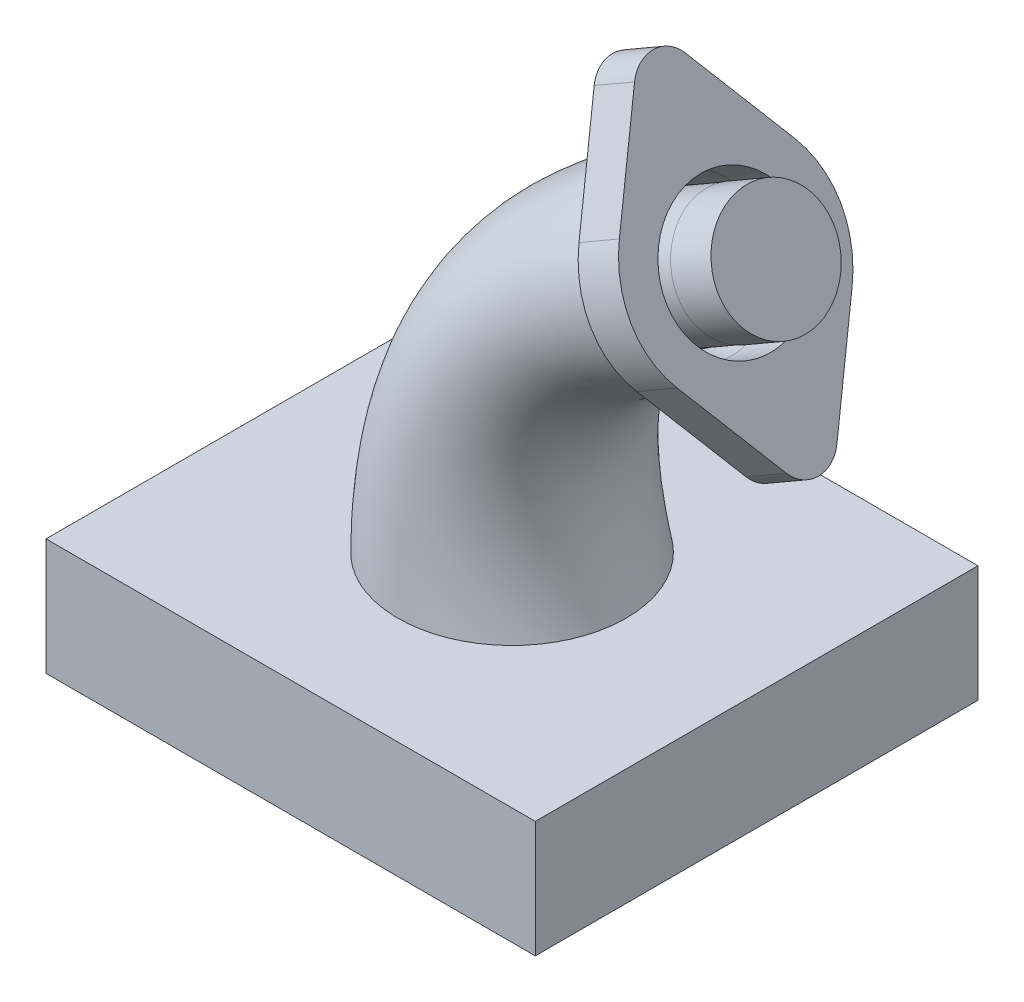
ISO-10303-21;
HEADER;
FILE_DESCRIPTION(('STEP AP214'),'2;1');
FILE_NAME('part.step','',(''),(''),'','','');
FILE_SCHEMA(('AUTOMOTIVE_DESIGN { 1 0 10303 214 1 1 1 1 }'));
ENDSEC;
DATA;
#1=APPLICATION_CONTEXT('core data for automotive mechanical design processes');
#2=APPLICATION_PROTOCOL_DEFINITION('international standard','automotive_design',2000,#1);
#3=PRODUCT_CONTEXT('',#1,'mechanical');
#4=PRODUCT('Part','Part','',(#3));
#5=PRODUCT_RELATED_PRODUCT_CATEGORY('part','',(#4));
#6=PRODUCT_DEFINITION_FORMATION('','',#4);
#7=PRODUCT_DEFINITION_CONTEXT('part definition',#1,'design');
#8=PRODUCT_DEFINITION('design','',#6,#7);
#9=PRODUCT_DEFINITION_SHAPE('','',#8);
#10=(LENGTH_UNIT() NAMED_UNIT(*) SI_UNIT(.MILLI.,.METRE.));
#11=(NAMED_UNIT(*) PLANE_ANGLE_UNIT() SI_UNIT($,.RADIAN.));
#12=(NAMED_UNIT(*) SI_UNIT($,.STERADIAN.) SOLID_ANGLE_UNIT());
#13=UNCERTAINTY_MEASURE_WITH_UNIT(LENGTH_MEASURE(1.E-05),#10,'distance_accuracy_value','');
#14=(GEOMETRIC_REPRESENTATION_CONTEXT(3) GLOBAL_UNCERTAINTY_ASSIGNED_CONTEXT((#13)) GLOBAL_UNIT_ASSIGNED_CONTEXT((#10,
#11,#12)) REPRESENTATION_CONTEXT('',''));
#15=CARTESIAN_POINT('',(0.,0.,0.));
#16=DIRECTION('',(0.,0.,1.));
#17=DIRECTION('',(1.,0.,0.));
#18=AXIS2_PLACEMENT_3D('',#15,#16,#17);
#19=CARTESIAN_POINT('',(41.804310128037,113.52547828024,0.));
#20=DIRECTION('',(0.86602540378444,0.499999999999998,0.));
#21=DIRECTION('',(-0.499999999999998,0.86602540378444,0.));
#22=AXIS2_PLACEMENT_3D('',#19,#20,#21);
#23=PLANE('',#22);
#24=CARTESIAN_POINT('',(48.0112066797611,102.77481809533,0.));
#25=DIRECTION('',(0.86602540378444,0.499999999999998,0.));
#26=DIRECTION('',(-0.499999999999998,0.86602540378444,0.));
#27=AXIS2_PLACEMENT_3D('',#24,#25,#26);
#28=CIRCLE('',#27,12.4137931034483);
#29=CARTESIAN_POINT('',(41.804310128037,113.52547828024,0.));
#30=VERTEX_POINT('',#29);
#31=EDGE_CURVE('E111',#30,#30,#28,.T.);
#32=ORIENTED_EDGE('',*,*,#31,.T.);
#33=EDGE_LOOP('',(#32));
#34=FACE_BOUND('',#33,.T.);
#35=CARTESIAN_POINT('',(48.0112066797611,102.77481809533,0.));
#36=DIRECTION('',(0.86602540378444,0.499999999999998,0.));
#37=DIRECTION('',(-0.499999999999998,0.86602540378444,0.));
#38=AXIS2_PLACEMENT_3D('',#35,#36,#37);
#39=CIRCLE('',#38,12.5);
#40=CARTESIAN_POINT('',(54.2612066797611,91.9495005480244,0.));
#41=VERTEX_POINT('',#40);
#42=EDGE_CURVE('E13',#41,#41,#39,.T.);
#43=ORIENTED_EDGE('',*,*,#42,.F.);
#44=EDGE_LOOP('',(#43));
#45=FACE_BOUND('',#44,.T.);
#46=ADVANCED_FACE('F107',(#34,#45),#23,.F.);
#47=CARTESIAN_POINT('',(31.8509526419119,110.765199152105,0.));
#48=DIRECTION('',(-0.86602540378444,-0.499999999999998,0.));
#49=DIRECTION('',(0.499999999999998,-0.86602540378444,0.));
#50=AXIS2_PLACEMENT_3D('',#47,#48,#49);
#51=PLANE('',#50);
#52=CARTESIAN_POINT('',(33.1009526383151,108.600135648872,0.));
#53=CARTESIAN_POINT('',(33.100952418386,108.600136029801,-0.163204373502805));
#54=CARTESIAN_POINT('',(33.1088536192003,108.58645074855,-0.979414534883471));
#55=CARTESIAN_POINT('',(33.203779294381,108.422034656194,-2.60754289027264));
#56=CARTESIAN_POINT('',(33.5370766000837,107.844746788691,-4.8138637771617));
#57=CARTESIAN_POINT('',(34.1204626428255,106.834292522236,-6.98476539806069));
#58=CARTESIAN_POINT('',(34.9024417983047,105.479864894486,-8.88991224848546));
#59=CARTESIAN_POINT('',(35.8553253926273,103.82942209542,-10.4565631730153));
#60=CARTESIAN_POINT('',(36.9408454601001,101.949246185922,-11.6257441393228));
#61=CARTESIAN_POINT('',(38.1207340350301,99.9056192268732,-12.3384811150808));
#62=CARTESIAN_POINT('',(39.347866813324,97.7801629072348,-12.5813770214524));
#63=CARTESIAN_POINT('',(40.5751194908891,95.6544989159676,-12.3410347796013));
#64=CARTESIAN_POINT('',(41.7554344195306,93.6101334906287,-11.6304408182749));
#65=CARTESIAN_POINT('',(42.8417539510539,91.7285728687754,-10.462581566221));
#66=CARTESIAN_POINT('',(43.7953782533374,90.0768471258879,-8.89805181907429));
#67=CARTESIAN_POINT('',(44.5776074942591,88.721986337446,-6.99744637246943));
#68=CARTESIAN_POINT('',(45.1629662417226,87.7081152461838,-4.81916844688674));
#69=CARTESIAN_POINT('',(45.5203995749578,87.0890225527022,-2.47239055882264));
#70=CARTESIAN_POINT('',(45.6413187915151,86.8795843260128,0.0142550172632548));
#71=CARTESIAN_POINT('',(45.5210673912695,87.0878658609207,2.45523514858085));
#72=CARTESIAN_POINT('',(45.0444433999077,87.9134028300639,5.60857937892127));
#73=CARTESIAN_POINT('',(43.8811226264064,89.9283335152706,9.06675195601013));
#74=CARTESIAN_POINT('',(42.1515091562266,92.9241119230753,11.3902401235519));
#75=CARTESIAN_POINT('',(40.5768087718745,95.651572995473,12.3410786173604));
#76=CARTESIAN_POINT('',(39.5539806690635,97.4231632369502,12.5408556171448));
#77=CARTESIAN_POINT('',(38.7360727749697,98.8398212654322,12.460121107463));
#78=CARTESIAN_POINT('',(37.9261289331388,100.242685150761,12.220875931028));
#79=CARTESIAN_POINT('',(36.9431210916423,101.945304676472,11.6280995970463));
#80=CARTESIAN_POINT('',(35.8569527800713,103.826603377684,10.4579766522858));
#81=CARTESIAN_POINT('',(34.9034860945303,105.478056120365,8.8917666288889));
#82=CARTESIAN_POINT('',(34.1219815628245,106.831661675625,6.99217379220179));
#83=CARTESIAN_POINT('',(33.5377766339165,107.843534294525,4.81093585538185));
#84=CARTESIAN_POINT('',(33.2044137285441,108.420935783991,2.62171050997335));
#85=CARTESIAN_POINT('',(33.108918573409,108.586338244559,0.980953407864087));
#86=CARTESIAN_POINT('',(33.1009528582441,108.600135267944,0.16320437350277));
#87=CARTESIAN_POINT('',(33.1009526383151,108.600135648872,0.));
#88=B_SPLINE_CURVE_WITH_KNOTS('',3,(#52,#53,#54,#55,#56,#57,#58,#59,#60,#61,#62,#63,#64,#65,#66,
#67,#68,#69,#70,#71,#72,#73,#74,#75,#76,#77,#78,#79,#80,#81,#82,#83,#84,#85,#86,#87),
.UNSPECIFIED.,.T.,.F.,(4,1,1,1,1,1,1,1,1,1,1,1,1,1,1,1,1,1,1,1,1,1,1,1,1,1,1,1,1,1,1,1,1,4),(0.,
0.00625000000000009,0.03125,0.0625,0.09375,0.125,0.15625,0.1875,0.21875,0.25,0.28125,0.3125,
0.34375,0.375,0.40625,0.4375,0.46875,0.5,0.53125,0.5625,0.625,0.6875,0.71875,0.75,0.765625,
0.78125,0.8125,0.84375,0.875,0.90625,0.9375,0.96875,0.99375,1.),.UNSPECIFIED.);
#89=CARTESIAN_POINT('',(33.1009526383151,108.600135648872,0.));
#90=VERTEX_POINT('',#89);
#91=EDGE_CURVE('E129',#90,#90,#88,.F.);
#92=ORIENTED_EDGE('',*,*,#91,.T.);
#93=EDGE_LOOP('',(#92));
#94=FACE_BOUND('',#93,.T.);
#95=CARTESIAN_POINT('',(39.3509526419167,97.7748180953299,0.));
#96=DIRECTION('',(0.86602540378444,0.499999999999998,0.));
#97=DIRECTION('',(-0.499999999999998,0.86602540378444,0.));
#98=AXIS2_PLACEMENT_3D('',#95,#96,#97);
#99=CIRCLE('',#98,12.4137931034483);
#100=CARTESIAN_POINT('',(33.1440560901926,108.52547828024,0.));
#101=VERTEX_POINT('',#100);
#102=EDGE_CURVE('E133',#101,#101,#99,.T.);
#103=ORIENTED_EDGE('',*,*,#102,.F.);
#104=EDGE_LOOP('',(#103));
#105=FACE_BOUND('',#104,.T.);
#106=ADVANCED_FACE('F186',(#94,#105),#51,.F.);
#107=CARTESIAN_POINT('',(56.6714607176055,107.77481809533,0.));
#108=DIRECTION('',(0.86602540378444,0.499999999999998,0.));
#109=DIRECTION('',(-0.499999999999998,0.86602540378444,0.));
#110=AXIS2_PLACEMENT_3D('',#107,#108,#109);
#111=CYLINDRICAL_SURFACE('',#110,12.4137931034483);
#112=ORIENTED_EDGE('',*,*,#31,.F.);
#113=EDGE_LOOP('',(#112));
#114=FACE_BOUND('',#113,.T.);
#115=ORIENTED_EDGE('',*,*,#102,.T.);
#116=EDGE_LOOP('',(#115));
#117=FACE_BOUND('',#116,.T.);
#118=ADVANCED_FACE('F196',(#114,#117),#111,.T.);
#119=CARTESIAN_POINT('',(0.,-25.,0.));
#120=DIRECTION('',(0.,-1.,0.));
#121=DIRECTION('',(0.,0.,-1.));
#122=AXIS2_PLACEMENT_3D('',#119,#120,#121);
#123=PLANE('',#122);
#124=CARTESIAN_POINT('',(0.,-25.,0.));
#125=DIRECTION('',(0.,-1.,0.));
#126=DIRECTION('',(0.,0.,-1.));
#127=AXIS2_PLACEMENT_3D('',#124,#125,#126);
#128=CIRCLE('',#127,15.);
#129=CARTESIAN_POINT('',(0.,-25.,-15.));
#130=VERTEX_POINT('',#129);
#131=EDGE_CURVE('E139',#130,#130,#128,.T.);
#132=ORIENTED_EDGE('',*,*,#131,.T.);
#133=EDGE_LOOP('',(#132));
#134=FACE_BOUND('',#133,.T.);
#135=ADVANCED_FACE('F175',(#134),#123,.T.);
#136=CARTESIAN_POINT('',(0.,-25.,0.));
#137=DIRECTION('',(0.,1.,0.));
#138=DIRECTION('',(0.,0.,1.));
#139=AXIS2_PLACEMENT_3D('',#136,#137,#138);
#140=CYLINDRICAL_SURFACE('',#139,15.);
#141=ORIENTED_EDGE('',*,*,#131,.F.);
#142=EDGE_LOOP('',(#141));
#143=FACE_BOUND('',#142,.T.);
#144=CARTESIAN_POINT('',(0.,0.,0.));
#145=DIRECTION('',(0.,-1.,0.));
#146=DIRECTION('',(0.,0.,-1.));
#147=AXIS2_PLACEMENT_3D('',#144,#145,#146);
#148=CIRCLE('',#147,15.);
#149=CARTESIAN_POINT('',(0.,0.,-15.));
#150=VERTEX_POINT('',#149);
#151=EDGE_CURVE('E146',#150,#150,#148,.T.);
#152=ORIENTED_EDGE('',*,*,#151,.T.);
#153=EDGE_LOOP('',(#152));
#154=FACE_BOUND('',#153,.T.);
#155=ADVANCED_FACE('F215',(#143,#154),#140,.T.);
#156=CARTESIAN_POINT('',(0.,0.,0.));
#157=DIRECTION('',(0.,-1.,0.));
#158=DIRECTION('',(0.,0.,-1.));
#159=AXIS2_PLACEMENT_3D('',#156,#157,#158);
#160=PLANE('',#159);
#161=CARTESIAN_POINT('',(0.,0.,0.));
#162=DIRECTION('',(0.,-1.,0.));
#163=DIRECTION('',(0.,0.,-1.));
#164=AXIS2_PLACEMENT_3D('',#161,#162,#163);
#165=CIRCLE('',#164,17.5);
#166=CARTESIAN_POINT('',(0.,0.,-17.5));
#167=VERTEX_POINT('',#166);
#168=EDGE_CURVE('E152',#167,#167,#165,.F.);
#169=ORIENTED_EDGE('',*,*,#168,.F.);
#170=EDGE_LOOP('',(#169));
#171=FACE_BOUND('',#170,.T.);
#172=ORIENTED_EDGE('',*,*,#151,.F.);
#173=EDGE_LOOP('',(#172));
#174=FACE_BOUND('',#173,.T.);
#175=ADVANCED_FACE('F109',(#171,#174),#160,.T.);
#176=CARTESIAN_POINT('',(0.,0.,0.));
#177=DIRECTION('',(0.,-1.,0.));
#178=DIRECTION('',(0.,0.,-1.));
#179=AXIS2_PLACEMENT_3D('',#176,#177,#178);
#180=CYLINDRICAL_SURFACE('',#179,17.5);
#181=ORIENTED_EDGE('',*,*,#168,.T.);
#182=EDGE_LOOP('',(#181));
#183=FACE_BOUND('',#182,.T.);
#184=CARTESIAN_POINT('',(-17.4999999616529,25.,1.36731446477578E-13));
#185=CARTESIAN_POINT('',(-17.4999989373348,25.,0.230784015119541));
#186=CARTESIAN_POINT('',(-17.4780380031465,25.,1.38128253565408));
#187=CARTESIAN_POINT('',(-17.2132741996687,25.,3.64896469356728));
#188=CARTESIAN_POINT('',(-16.2731424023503,25.,6.74884493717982));
#189=CARTESIAN_POINT('',(-14.6477195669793,25.,9.7767837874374));
#190=CARTESIAN_POINT('',(-12.4468154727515,25.,12.4550946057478));
#191=CARTESIAN_POINT('',(-9.78972141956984,25.,14.6387812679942));
#192=CARTESIAN_POINT('',(-6.73796788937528,25.,16.2781508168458));
#193=CARTESIAN_POINT('',(-3.99730685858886,25.,17.1082699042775));
#194=CARTESIAN_POINT('',(-1.7108853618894,25.,17.4470287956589));
#195=CARTESIAN_POINT('',(0.597356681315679,25.0000000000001,17.5543764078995));
#196=CARTESIAN_POINT('',(3.44826358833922,24.9999999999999,17.2755320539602));
#197=CARTESIAN_POINT('',(7.86001517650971,25.0000000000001,15.9360346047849));
#198=CARTESIAN_POINT('',(12.7023985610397,24.9999999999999,12.6783081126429));
#199=CARTESIAN_POINT('',(15.9487412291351,25.0000000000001,7.83294582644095));
#200=CARTESIAN_POINT('',(17.2811061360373,25.,3.42131630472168));
#201=CARTESIAN_POINT('',(17.6107506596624,25.,-0.0101083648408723));
#202=CARTESIAN_POINT('',(17.2762929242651,25.,-3.45213514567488));
#203=CARTESIAN_POINT('',(16.2710204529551,25.,-6.7497993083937));
#204=CARTESIAN_POINT('',(14.6383586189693,25.,-9.79443416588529));
#205=CARTESIAN_POINT('',(12.442482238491,25.,-12.4560836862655));
#206=CARTESIAN_POINT('',(9.77830103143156,25.,-14.6491824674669));
#207=CARTESIAN_POINT('',(6.7326678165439,25.,-16.2779926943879));
#208=CARTESIAN_POINT('',(3.43371623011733,25.,-17.280148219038));
#209=CARTESIAN_POINT('',(-0.00895426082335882,25.,-17.6104690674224));
#210=CARTESIAN_POINT('',(-3.43982640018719,25.,-17.2779259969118));
#211=CARTESIAN_POINT('',(-6.7467440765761,25.,-16.2740838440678));
#212=CARTESIAN_POINT('',(-9.78778253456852,25.,-14.6401712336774));
#213=CARTESIAN_POINT('',(-12.4522094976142,25.0000000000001,-12.4497897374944));
#214=CARTESIAN_POINT('',(-14.6463250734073,24.9999999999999,-9.77854950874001));
#215=CARTESIAN_POINT('',(-16.2783747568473,25.,-6.73760457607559));
#216=CARTESIAN_POINT('',(-17.2077530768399,25.,-3.66594945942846));
#217=CARTESIAN_POINT('',(-17.4774182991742,25.,-1.38318262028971));
#218=CARTESIAN_POINT('',(-17.500000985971,25.,-0.230784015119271));
#219=CARTESIAN_POINT('',(-17.4999999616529,25.,1.36731446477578E-13));
#220=B_SPLINE_CURVE_WITH_KNOTS('',3,(#184,#185,#186,#187,#188,#189,#190,#191,#192,#193,#194,
#195,#196,#197,#198,#199,#200,#201,#202,#203,#204,#205,#206,#207,#208,#209,#210,#211,#212,#213,
#214,#215,#216,#217,#218,#219),.UNSPECIFIED.,.T.,.F.,(4,1,1,1,1,1,1,1,1,1,1,1,1,1,1,1,1,1,1,1,1,
1,1,1,1,1,1,1,1,1,1,1,1,4),(0.,0.00624999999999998,0.03125,0.0625,0.09375,0.125,0.15625,0.1875,
0.21875,0.234375,0.25,0.28125,0.3125,0.375,0.4375,0.46875,0.5,0.53125,0.5625,0.59375,0.625,
0.65625,0.6875,0.71875,0.75,0.78125,0.8125,0.84375,0.875,0.90625,0.9375,0.96875,0.99375,1.),.UNSPECIFIED.);
#221=CARTESIAN_POINT('',(-17.4999999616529,25.,1.36731446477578E-13));
#222=VERTEX_POINT('',#221);
#223=EDGE_CURVE('E123',#222,#222,#220,.F.);
#224=ORIENTED_EDGE('',*,*,#223,.T.);
#225=EDGE_LOOP('',(#224));
#226=FACE_BOUND('',#225,.T.);
#227=ADVANCED_FACE('F173',(#183,#226),#180,.T.);
#228=CARTESIAN_POINT('',(33.1009526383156,108.600135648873,0.));
#229=CARTESIAN_POINT('',(21.9110935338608,102.139667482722,0.));
#230=CARTESIAN_POINT('',(7.86025460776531,91.6000519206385,0.));
#231=CARTESIAN_POINT('',(-4.83389269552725,74.3100298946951,0.));
#232=CARTESIAN_POINT('',(-12.5903042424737,59.0846350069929,0.));
#233=CARTESIAN_POINT('',(-16.7556684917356,42.1673576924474,0.));
#234=CARTESIAN_POINT('',(-17.4999999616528,29.278799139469,0.));
#235=CARTESIAN_POINT('',(-17.4999999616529,25.,1.36731446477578E-13));
#236=CARTESIAN_POINT('',(33.1009524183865,108.600136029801,-0.163204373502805));
#237=CARTESIAN_POINT('',(21.9110932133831,102.139667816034,-0.171651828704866));
#238=CARTESIAN_POINT('',(7.86025415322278,91.6000521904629,-0.182915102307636));
#239=CARTESIAN_POINT('',(-4.83389331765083,74.3100300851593,-0.196994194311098));
#240=CARTESIAN_POINT('',(-12.5903049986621,59.084635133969,-0.208257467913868));
#241=CARTESIAN_POINT('',(-16.7556693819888,42.1673577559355,-0.219520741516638));
#242=CARTESIAN_POINT('',(-17.5000009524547,29.278799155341,-0.227968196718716));
#243=CARTESIAN_POINT('',(-17.500000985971,25.,-0.230784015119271));
#244=CARTESIAN_POINT('',(33.1088536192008,108.58645074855,-0.979414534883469));
#245=CARTESIAN_POINT('',(21.9208295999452,102.12769319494,-1.02988554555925));
#246=CARTESIAN_POINT('',(7.87243745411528,91.5903584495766,-1.09718022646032));
#247=CARTESIAN_POINT('',(-4.81865137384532,74.3031874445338,-1.18129857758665));
#248=CARTESIAN_POINT('',(-12.5726161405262,59.080073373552,-1.24859325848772));
#249=CARTESIAN_POINT('',(-16.7355336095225,42.165076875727,-1.31588793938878));
#250=CARTESIAN_POINT('',(-17.4780299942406,29.2782289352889,-1.36635895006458));
#251=CARTESIAN_POINT('',(-17.4774182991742,25.,-1.38318262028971));
#252=CARTESIAN_POINT('',(33.2037792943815,108.422034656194,-2.60754289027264));
#253=CARTESIAN_POINT('',(22.0375977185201,101.983829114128,-2.73984371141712));
#254=CARTESIAN_POINT('',(8.01832883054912,91.4738970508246,-2.91624480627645));
#255=CARTESIAN_POINT('',(-4.6363559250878,74.2209793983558,-3.13674617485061));
#256=CARTESIAN_POINT('',(-12.3611974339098,59.0252680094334,-3.31314726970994));
#257=CARTESIAN_POINT('',(-16.4949916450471,42.1376741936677,-3.48954836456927));
#258=CARTESIAN_POINT('',(-17.215645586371,29.2713782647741,-3.62184918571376));
#259=CARTESIAN_POINT('',(-17.2077530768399,25.,-3.66594945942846));
#260=CARTESIAN_POINT('',(33.5370766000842,107.844746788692,-4.81386377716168));
#261=CARTESIAN_POINT('',(22.4454051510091,101.478702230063,-5.05433137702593));
#262=CARTESIAN_POINT('',(8.52548309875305,91.0649848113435,-5.3749548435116));
#263=CARTESIAN_POINT('',(-4.00501811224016,73.9323354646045,-5.7757341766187));
#264=CARTESIAN_POINT('',(-11.6305127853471,58.8328387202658,-6.09635764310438));
#265=CARTESIAN_POINT('',(-15.6649601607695,42.0414595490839,-6.41698110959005));
#266=CARTESIAN_POINT('',(-16.3111039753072,29.2473246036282,-6.65744870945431));
#267=CARTESIAN_POINT('',(-16.2783747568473,25.,-6.73760457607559));
#268=CARTESIAN_POINT('',(34.1204626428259,106.834292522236,-6.98476539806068));
#269=CARTESIAN_POINT('',(23.1598741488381,100.594554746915,-7.3339884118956));
#270=CARTESIAN_POINT('',(9.4147293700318,90.3492463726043,-7.79961909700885));
#271=CARTESIAN_POINT('',(-2.89730024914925,73.4271083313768,-8.38165745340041));
#272=CARTESIAN_POINT('',(-10.3480176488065,58.4960206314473,-8.84728813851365));
#273=CARTESIAN_POINT('',(-14.2076877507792,41.8730505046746,-9.3129188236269));
#274=CARTESIAN_POINT('',(-14.7227486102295,29.2052223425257,-9.66214183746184));
#275=CARTESIAN_POINT('',(-14.6463250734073,24.9999999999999,-9.77854950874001));
#276=CARTESIAN_POINT('',(34.9024417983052,105.479864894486,-8.88991224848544));
#277=CARTESIAN_POINT('',(24.1183703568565,99.4094305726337,-9.33489693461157));
#278=CARTESIAN_POINT('',(10.6085816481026,89.3898601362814,-9.92820984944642));
#279=CARTESIAN_POINT('',(-1.4092528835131,72.7498945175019,-10.66985099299));
#280=CARTESIAN_POINT('',(-8.62461421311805,58.0445447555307,-11.2631639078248));
#281=CARTESIAN_POINT('',(-12.2489282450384,41.6473125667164,-11.8564768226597));
#282=CARTESIAN_POINT('',(-12.5874720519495,29.1487878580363,-12.3014615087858));
#283=CARTESIAN_POINT('',(-12.4522094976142,25.0000000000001,-12.4497897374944));
#284=CARTESIAN_POINT('',(35.8553253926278,103.829422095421,-10.4565631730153));
#285=CARTESIAN_POINT('',(25.2851968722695,97.9652931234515,-10.979514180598));
#286=CARTESIAN_POINT('',(12.0606653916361,88.2207964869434,-11.6767821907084));
#287=CARTESIAN_POINT('',(0.399402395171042,71.9246731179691,-12.5483672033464));
#288=CARTESIAN_POINT('',(-6.53070170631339,57.4943971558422,-13.2456352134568));
#289=CARTESIAN_POINT('',(-9.86975851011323,41.372238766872,-13.9429032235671));
#290=CARTESIAN_POINT('',(-9.99435939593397,29.0800194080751,-14.4658542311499));
#291=CARTESIAN_POINT('',(-9.78778253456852,25.,-14.6401712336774));
#292=CARTESIAN_POINT('',(36.9408454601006,101.949246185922,-11.6257441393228));
#293=CARTESIAN_POINT('',(26.6151567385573,96.3201392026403,-12.206786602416));
#294=CARTESIAN_POINT('',(13.7165449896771,86.8890052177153,-12.9815098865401));
#295=CARTESIAN_POINT('',(2.46268165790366,70.9845851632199,-13.9499139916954));
#296=CARTESIAN_POINT('',(-4.14150271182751,56.8676718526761,-14.7246372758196));
#297=CARTESIAN_POINT('',(-7.15463978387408,41.058876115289,-15.4993605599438));
#298=CARTESIAN_POINT('',(-7.03480087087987,29.0016787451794,-16.0804030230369));
#299=CARTESIAN_POINT('',(-6.7467440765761,25.,-16.2740838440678));
#300=CARTESIAN_POINT('',(38.1207340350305,99.9056192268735,-12.3384811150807));
#301=CARTESIAN_POINT('',(28.0609239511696,94.5319656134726,-12.9559117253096));
#302=CARTESIAN_POINT('',(15.5168170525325,85.4414361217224,-13.7791525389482));
#303=CARTESIAN_POINT('',(4.70608478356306,69.9627716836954,-14.8082035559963));
#304=CARTESIAN_POINT('',(-1.54359473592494,56.1864628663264,-15.6314443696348));
#305=CARTESIAN_POINT('',(-4.20222695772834,40.7182716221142,-16.4546851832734));
#306=CARTESIAN_POINT('',(-3.81650940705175,28.9165276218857,-17.0721157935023));
#307=CARTESIAN_POINT('',(-3.43982640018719,25.,-17.2779259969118));
#308=CARTESIAN_POINT('',(39.3478668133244,97.780162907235,-12.5813770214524));
#309=CARTESIAN_POINT('',(29.5635241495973,92.672191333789,-13.2100135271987));
#310=CARTESIAN_POINT('',(17.3867071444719,83.9359045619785,-14.0481955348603));
#311=CARTESIAN_POINT('',(7.03508724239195,68.9000435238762,-15.0959230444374));
#312=CARTESIAN_POINT('',(1.1526976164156,55.477977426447,-15.9341050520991));
#313=CARTESIAN_POINT('',(-1.13864471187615,40.3640289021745,-16.7722870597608));
#314=CARTESIAN_POINT('',(-0.477459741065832,28.8279669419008,-17.4009235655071));
#315=CARTESIAN_POINT('',(-0.00895426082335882,25.,-17.6104690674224));
#316=CARTESIAN_POINT('',(40.5751194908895,95.6544989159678,-12.3410347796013));
#317=CARTESIAN_POINT('',(31.0677040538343,90.8122353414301,-12.9584239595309));
#318=CARTESIAN_POINT('',(19.2601233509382,82.4302259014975,-13.7816095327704));
#319=CARTESIAN_POINT('',(9.37004882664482,67.8372115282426,-14.8105914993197));
#320=CARTESIAN_POINT('',(3.85689550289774,54.7694227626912,-15.6337770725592));
#321=CARTESIAN_POINT('',(1.93478947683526,40.0097515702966,-16.4569626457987));
#322=CARTESIAN_POINT('',(2.87290167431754,28.7393976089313,-17.0743518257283));
#323=CARTESIAN_POINT('',(3.43371623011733,25.,-17.280148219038));
#324=CARTESIAN_POINT('',(41.755434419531,93.6101334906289,-11.6304408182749));
#325=CARTESIAN_POINT('',(32.5128485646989,89.0234155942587,-12.2113848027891));
#326=CARTESIAN_POINT('',(21.0583739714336,80.9821337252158,-12.9859767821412));
#327=CARTESIAN_POINT('',(11.6096820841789,66.8150288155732,-13.9542167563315));
#328=CARTESIAN_POINT('',(6.44963487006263,54.0879676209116,-14.7288087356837));
#329=CARTESIAN_POINT('',(4.88063495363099,39.6690239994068,-15.5034007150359));
#330=CARTESIAN_POINT('',(6.0835767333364,28.6542157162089,-16.08434469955));
#331=CARTESIAN_POINT('',(6.7326678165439,25.,-16.2779926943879));
#332=CARTESIAN_POINT('',(42.8417539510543,91.7285728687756,-10.462581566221));
#333=CARTESIAN_POINT('',(33.8440823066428,87.377050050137,-10.9859066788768));
#334=CARTESIAN_POINT('',(22.7161599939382,79.6493616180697,-11.6836734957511));
#335=CARTESIAN_POINT('',(13.6756584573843,65.8742485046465,-12.555882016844));
#336=CARTESIAN_POINT('',(8.84216352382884,53.4607807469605,-13.2536488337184));
#337=CARTESIAN_POINT('',(7.59971588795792,39.3554305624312,-13.9514156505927));
#338=CARTESIAN_POINT('',(9.04757187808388,28.575817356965,-14.4747407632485));
#339=CARTESIAN_POINT('',(9.77830103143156,25.,-14.6491824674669));
#340=CARTESIAN_POINT('',(43.7953782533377,90.076847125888,-8.89805181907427));
#341=CARTESIAN_POINT('',(35.0115262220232,85.9317900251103,-9.34280580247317));
#342=CARTESIAN_POINT('',(24.1686967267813,78.4793892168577,-9.93581111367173));
#343=CARTESIAN_POINT('',(15.4845612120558,65.0483856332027,-10.6770677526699));
#344=CARTESIAN_POINT('',(10.9361590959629,52.9102054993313,-11.2700730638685));
#345=CARTESIAN_POINT('',(9.97880427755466,39.0801429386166,-11.863078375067));
#346=CARTESIAN_POINT('',(11.6404798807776,28.5069954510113,-12.3078323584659));
#347=CARTESIAN_POINT('',(12.442482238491,25.,-12.4560836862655));
#348=CARTESIAN_POINT('',(44.5776074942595,88.7219863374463,-6.99744637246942));
#349=CARTESIAN_POINT('',(35.9704613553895,84.7462868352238,-7.34706984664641));
#350=CARTESIAN_POINT('',(25.3632397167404,77.5196961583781,-7.81323447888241));
#351=CARTESIAN_POINT('',(16.9736140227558,64.3709552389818,-8.39594026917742));
#352=CARTESIAN_POINT('',(12.6608197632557,52.4585852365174,-8.86210490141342));
#353=CARTESIAN_POINT('',(11.9390728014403,38.8543328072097,-9.32826953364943));
#354=CARTESIAN_POINT('',(13.7774542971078,28.4505429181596,-9.67789300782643));
#355=CARTESIAN_POINT('',(14.6383586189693,25.,-9.79443416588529));
#356=CARTESIAN_POINT('',(45.1629662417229,87.708115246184,-4.81916844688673));
#357=CARTESIAN_POINT('',(36.6867329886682,83.8591496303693,-5.0604973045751));
#358=CARTESIAN_POINT('',(26.2540618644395,76.801537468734,-5.38226911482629));
#359=CARTESIAN_POINT('',(18.0826243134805,63.8640196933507,-5.78448387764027));
#360=CARTESIAN_POINT('',(13.9443805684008,52.1206282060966,-6.10625568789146));
#361=CARTESIAN_POINT('',(13.3971841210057,38.6853542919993,-6.42802749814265));
#362=CARTESIAN_POINT('',(15.3664785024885,28.408298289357,-6.66935635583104));
#363=CARTESIAN_POINT('',(16.2710204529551,25.,-6.7497993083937));
#364=CARTESIAN_POINT('',(45.5203995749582,87.0890225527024,-2.47239055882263));
#365=CARTESIAN_POINT('',(37.1251462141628,83.3174435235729,-2.59485863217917));
#366=CARTESIAN_POINT('',(26.8004482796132,76.3630134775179,-2.75814939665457));
#367=CARTESIAN_POINT('',(18.7639772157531,63.5544733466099,-2.96226285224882));
#368=CARTESIAN_POINT('',(14.7337066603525,51.9142639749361,-3.12555361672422));
#369=CARTESIAN_POINT('',(14.2944834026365,38.582172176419,-3.28884438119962));
#370=CARTESIAN_POINT('',(16.3447576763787,28.3825027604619,-3.41131245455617));
#371=CARTESIAN_POINT('',(17.2762929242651,25.,-3.45213514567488));
#372=CARTESIAN_POINT('',(45.6413187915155,86.879584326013,0.014255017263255));
#373=CARTESIAN_POINT('',(37.2727577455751,83.1341850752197,0.0112095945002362));
#374=CARTESIAN_POINT('',(26.9836495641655,76.2146614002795,0.00714903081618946));
#375=CARTESIAN_POINT('',(18.9916656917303,63.4497542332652,0.00207332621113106));
#376=CARTESIAN_POINT('',(14.9969848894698,51.8444512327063,-0.00198723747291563));
#377=CARTESIAN_POINT('',(14.5933513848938,38.5472658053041,-0.00604780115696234));
#378=CARTESIAN_POINT('',(16.6703179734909,28.3737761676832,-0.00909322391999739));
#379=CARTESIAN_POINT('',(17.6107506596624,25.,-0.0101083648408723));
#380=CARTESIAN_POINT('',(45.5210673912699,87.0878658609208,2.45523514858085));
#381=CARTESIAN_POINT('',(37.1263322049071,83.316431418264,2.57599529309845));
#382=CARTESIAN_POINT('',(26.8023251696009,76.3621941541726,2.7370088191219));
#383=CARTESIAN_POINT('',(18.766717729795,63.5538950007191,2.9382757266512));
#384=CARTESIAN_POINT('',(14.7371380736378,51.9138784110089,3.09928925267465));
#385=CARTESIAN_POINT('',(14.2986057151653,38.5819793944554,3.2603027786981));
#386=CARTESIAN_POINT('',(16.34939816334,28.382454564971,3.38106292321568));
#387=CARTESIAN_POINT('',(17.2811061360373,25.,3.42131630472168));
#388=CARTESIAN_POINT('',(45.0444433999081,87.9134028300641,5.60857937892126));
#389=CARTESIAN_POINT('',(36.5427405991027,84.0387762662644,5.88662518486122));
#390=CARTESIAN_POINT('',(26.0761100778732,76.9469495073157,6.25735292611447));
#391=CARTESIAN_POINT('',(17.862223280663,63.9666634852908,6.72076260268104));
#392=CARTESIAN_POINT('',(13.6900201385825,52.1890574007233,7.0914903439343));
#393=CARTESIAN_POINT('',(13.1088642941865,38.7195688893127,7.46221808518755));
#394=CARTESIAN_POINT('',(15.0526891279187,28.4168519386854,7.7402638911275));
#395=CARTESIAN_POINT('',(15.9487412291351,25.0000000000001,7.83294582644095));
#396=CARTESIAN_POINT('',(43.8811226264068,89.9283335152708,9.06675195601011));
#397=CARTESIAN_POINT('',(35.1190420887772,85.8018406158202,9.51819647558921));
#398=CARTESIAN_POINT('',(24.3052412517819,78.3741920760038,10.1201225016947));
#399=CARTESIAN_POINT('',(15.6573915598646,64.974128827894,10.8725300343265));
#400=CARTESIAN_POINT('',(11.1380181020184,52.8607009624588,11.4744560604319));
#401=CARTESIAN_POINT('',(10.2096919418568,39.0553906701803,12.0763820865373));
#402=CARTESIAN_POINT('',(11.8931390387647,28.5008073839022,12.5278266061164));
#403=CARTESIAN_POINT('',(12.7023985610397,24.9999999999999,12.6783081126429));
#404=CARTESIAN_POINT('',(42.151509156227,92.9241119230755,11.3902401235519));
#405=CARTESIAN_POINT('',(33.0003323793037,88.4231467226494,11.958464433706));
#406=CARTESIAN_POINT('',(21.6677365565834,80.4962017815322,12.7160968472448));
#407=CARTESIAN_POINT('',(12.3713931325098,66.4720180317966,13.6631373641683));
#408=CARTESIAN_POINT('',(7.33322468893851,53.8592937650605,14.4207697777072));
#409=CARTESIAN_POINT('',(5.88610354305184,39.5546870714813,15.178402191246));
#410=CARTESIAN_POINT('',(7.18045440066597,28.6256314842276,15.7466265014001));
#411=CARTESIAN_POINT('',(7.86001517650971,25.0000000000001,15.9360346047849));
#412=CARTESIAN_POINT('',(40.5768087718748,95.6515729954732,12.3410786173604));
#413=CARTESIAN_POINT('',(31.0710005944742,90.8096751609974,12.9578852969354));
#414=CARTESIAN_POINT('',(19.2655629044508,82.4281533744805,13.7802942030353));
#415=CARTESIAN_POINT('',(9.37816714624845,67.8357485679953,14.8083053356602));
#416=CARTESIAN_POINT('',(3.86715683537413,54.7684474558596,15.6307142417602));
#417=CARTESIAN_POINT('',(1.9471938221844,40.0092639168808,16.4531231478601));
#418=CARTESIAN_POINT('',(2.88691327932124,28.7392756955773,17.0699298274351));
#419=CARTESIAN_POINT('',(3.44826358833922,24.9999999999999,17.2755320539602));
#420=CARTESIAN_POINT('',(39.553980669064,97.4231632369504,12.5408556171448));
#421=CARTESIAN_POINT('',(29.8196626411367,92.35981662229,13.1675457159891));
#422=CARTESIAN_POINT('',(17.7095451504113,83.6830297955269,14.0031325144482));
#423=CARTESIAN_POINT('',(7.44129964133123,68.721543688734,15.0476160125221));
#424=CARTESIAN_POINT('',(1.6256095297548,55.3589775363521,15.8832028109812));
#425=CARTESIAN_POINT('',(-0.599033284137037,40.3045289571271,16.7187896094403));
#426=CARTESIAN_POINT('',(0.112176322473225,28.813091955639,17.3454797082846));
#427=CARTESIAN_POINT('',(0.597356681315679,25.0000000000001,17.5543764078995));
#428=CARTESIAN_POINT('',(38.7360727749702,98.8398212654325,12.460121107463));
#429=CARTESIAN_POINT('',(28.815462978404,93.5993923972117,13.0834845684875));
#430=CARTESIAN_POINT('',(16.4569564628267,84.686495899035,13.9146358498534));
#431=CARTESIAN_POINT('',(5.8782246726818,69.429872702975,14.9535749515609));
#432=CARTESIAN_POINT('',(-0.185854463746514,55.8311968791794,15.7847262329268));
#433=CARTESIAN_POINT('',(-2.65888630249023,40.5406386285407,16.6158775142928));
#434=CARTESIAN_POINT('',(-2.13396846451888,28.8721193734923,17.2392409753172));
#435=CARTESIAN_POINT('',(-1.7108853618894,25.,17.4470287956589));
#436=CARTESIAN_POINT('',(37.9261289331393,100.242685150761,12.220875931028));
#437=CARTESIAN_POINT('',(27.8209594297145,94.8268982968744,12.8318001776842));
#438=CARTESIAN_POINT('',(15.2163733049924,85.6801911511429,13.6463658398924));
#439=CARTESIAN_POINT('',(4.33004200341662,70.1313046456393,14.6645729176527));
#440=CARTESIAN_POINT('',(-1.98011674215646,56.298818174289,15.4791385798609));
#441=CARTESIAN_POINT('',(-4.69922819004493,40.7744492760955,16.2937042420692));
#442=CARTESIAN_POINT('',(-4.35887005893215,28.930572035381,16.9046284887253));
#443=CARTESIAN_POINT('',(-3.99730685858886,25.,17.1082699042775));
#444=CARTESIAN_POINT('',(36.9431210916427,101.945304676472,11.6280995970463));
#445=CARTESIAN_POINT('',(26.6182449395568,96.3166903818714,12.2093559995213));
#446=CARTESIAN_POINT('',(13.7207166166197,86.886213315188,12.9843645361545));
#447=CARTESIAN_POINT('',(2.46820756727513,70.9826144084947,13.953125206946));
#448=CARTESIAN_POINT('',(-4.13489337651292,56.8663580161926,14.7281337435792));
#449=CARTESIAN_POINT('',(-7.14694702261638,41.0582191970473,15.5031422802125));
#450=CARTESIAN_POINT('',(-7.02629554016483,29.001514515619,16.0843986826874));
#451=CARTESIAN_POINT('',(-6.73796788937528,25.,16.2781508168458));
#452=CARTESIAN_POINT('',(35.8569527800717,103.826603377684,10.4579766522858));
#453=CARTESIAN_POINT('',(25.2863784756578,97.9628267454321,10.9805772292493));
#454=CARTESIAN_POINT('',(12.0612526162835,88.2187998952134,11.677377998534));
#455=CARTESIAN_POINT('',(0.399246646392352,71.9232637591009,12.5483789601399));
#456=CARTESIAN_POINT('',(-6.53145183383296,57.4934575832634,13.2451797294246));
#457=CARTESIAN_POINT('',(-9.87110301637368,41.3717689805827,13.9419804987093));
#458=CARTESIAN_POINT('',(-9.99614968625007,29.0799019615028,14.4645810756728));
#459=CARTESIAN_POINT('',(-9.78972141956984,25.,14.6387812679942));
#460=CARTESIAN_POINT('',(34.9034860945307,105.478056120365,8.89176662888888));
#461=CARTESIAN_POINT('',(24.1199583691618,99.4078478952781,9.33718262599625));
#462=CARTESIAN_POINT('',(10.6108946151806,89.3885789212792,9.93107062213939));
#463=CARTESIAN_POINT('',(-1.40603372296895,72.7489901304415,10.6734306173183));
#464=CARTESIAN_POINT('',(-8.62067009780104,58.0439418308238,11.2673186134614));
#465=CARTESIAN_POINT('',(-12.2442591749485,41.6470111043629,11.8612066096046));
#466=CARTESIAN_POINT('',(-12.58225926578,29.1487124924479,12.3066226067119));
#467=CARTESIAN_POINT('',(-12.4468154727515,25.,12.4550946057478));
#468=CARTESIAN_POINT('',(34.1219815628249,106.831661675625,6.99217379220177));
#469=CARTESIAN_POINT('',(23.1610288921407,100.592252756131,7.34025004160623));
#470=CARTESIAN_POINT('',(9.41539854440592,90.347382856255,7.8043517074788));
#471=CARTESIAN_POINT('',(-2.89723803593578,73.4257929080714,8.38447878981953));
#472=CARTESIAN_POINT('',(-10.3484410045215,58.4951436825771,8.84858045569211));
#473=CARTESIAN_POINT('',(-14.2085966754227,41.8726120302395,9.31268212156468));
#474=CARTESIAN_POINT('',(-14.7240217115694,29.205112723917,9.66075837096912));
#475=CARTESIAN_POINT('',(-14.6477195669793,25.,9.7767837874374));
#476=CARTESIAN_POINT('',(33.537776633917,107.843534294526,4.81093585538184));
#477=CARTESIAN_POINT('',(22.4466717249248,101.477641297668,5.05317449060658));
#478=CARTESIAN_POINT('',(8.52750505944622,91.0641259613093,5.37615933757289));
#479=CARTESIAN_POINT('',(-4.00205191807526,73.9317292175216,5.77989039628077));
#480=CARTESIAN_POINT('',(-11.6267912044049,58.8324345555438,6.10287524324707));
#481=CARTESIAN_POINT('',(-15.6604831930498,42.0412574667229,6.42586009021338));
#482=CARTESIAN_POINT('',(-16.3060604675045,29.2472740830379,6.66809872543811));
#483=CARTESIAN_POINT('',(-16.2731424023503,25.,6.74884493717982));
#484=CARTESIAN_POINT('',(33.2044137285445,108.420935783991,2.62171050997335));
#485=CARTESIAN_POINT('',(22.0374627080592,101.98286760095,2.75011728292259));
#486=CARTESIAN_POINT('',(8.01716789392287,91.4731186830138,2.92132631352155));
#487=CARTESIAN_POINT('',(-4.63879926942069,74.2204299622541,3.13533760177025));
#488=CARTESIAN_POINT('',(-12.364666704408,59.0249017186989,3.30654663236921));
#489=CARTESIAN_POINT('',(-16.4994868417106,42.1374910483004,3.47775566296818));
#490=CARTESIAN_POINT('',(-17.2209102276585,29.2713324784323,3.6061624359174));
#491=CARTESIAN_POINT('',(-17.2132741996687,25.,3.64896469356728));
#492=CARTESIAN_POINT('',(33.1089185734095,108.586338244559,0.980953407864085));
#493=CARTESIAN_POINT('',(21.9208089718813,102.127594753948,1.03099454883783));
#494=CARTESIAN_POINT('',(7.87230271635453,91.5902787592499,1.09771607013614));
#495=CARTESIAN_POINT('',(-4.81892874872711,74.3031311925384,1.18111797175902));
#496=CARTESIAN_POINT('',(-12.5730076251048,59.0800358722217,1.24783949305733));
#497=CARTESIAN_POINT('',(-16.736039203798,42.1650581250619,1.31456101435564));
#498=CARTESIAN_POINT('',(-17.4786211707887,29.2782242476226,1.36460215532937));
#499=CARTESIAN_POINT('',(-17.4780380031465,25.,1.38128253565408));
#500=CARTESIAN_POINT('',(33.1009528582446,108.600135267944,0.16320437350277));
#501=CARTESIAN_POINT('',(21.9110938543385,102.13966714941,0.171651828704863));
#502=CARTESIAN_POINT('',(7.86025506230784,91.6000516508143,0.182915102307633));
#503=CARTESIAN_POINT('',(-4.83389207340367,74.3100297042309,0.196994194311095));
#504=CARTESIAN_POINT('',(-12.5903034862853,59.0846348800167,0.208257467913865));
#505=CARTESIAN_POINT('',(-16.7556676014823,42.1673576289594,0.219520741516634));
#506=CARTESIAN_POINT('',(-17.4999989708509,29.278799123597,0.227968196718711));
#507=CARTESIAN_POINT('',(-17.4999989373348,25.,0.230784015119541));
#508=CARTESIAN_POINT('',(33.1009526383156,108.600135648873,0.));
#509=CARTESIAN_POINT('',(21.9110935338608,102.139667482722,0.));
#510=CARTESIAN_POINT('',(7.86025460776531,91.6000519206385,0.));
#511=CARTESIAN_POINT('',(-4.83389269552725,74.3100298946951,0.));
#512=CARTESIAN_POINT('',(-12.5903042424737,59.0846350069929,0.));
#513=CARTESIAN_POINT('',(-16.7556684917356,42.1673576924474,0.));
#514=CARTESIAN_POINT('',(-17.4999999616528,29.278799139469,0.));
#515=CARTESIAN_POINT('',(-17.4999999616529,25.,1.36731446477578E-13));
#516=B_SPLINE_SURFACE_WITH_KNOTS('',3,3,((#228,#229,#230,#231,#232,#233,#234,#235),(#236,#237,
#238,#239,#240,#241,#242,#243),(#244,#245,#246,#247,#248,#249,#250,#251),(#252,#253,#254,#255,
#256,#257,#258,#259),(#260,#261,#262,#263,#264,#265,#266,#267),(#268,#269,#270,#271,#272,#273,
#274,#275),(#276,#277,#278,#279,#280,#281,#282,#283),(#284,#285,#286,#287,#288,#289,#290,#291),
(#292,#293,#294,#295,#296,#297,#298,#299),(#300,#301,#302,#303,#304,#305,#306,#307),(#308,#309,
#310,#311,#312,#313,#314,#315),(#316,#317,#318,#319,#320,#321,#322,#323),(#324,#325,#326,#327,
#328,#329,#330,#331),(#332,#333,#334,#335,#336,#337,#338,#339),(#340,#341,#342,#343,#344,#345,
#346,#347),(#348,#349,#350,#351,#352,#353,#354,#355),(#356,#357,#358,#359,#360,#361,#362,#363),
(#364,#365,#366,#367,#368,#369,#370,#371),(#372,#373,#374,#375,#376,#377,#378,#379),(#380,#381,
#382,#383,#384,#385,#386,#387),(#388,#389,#390,#391,#392,#393,#394,#395),(#396,#397,#398,#399,
#400,#401,#402,#403),(#404,#405,#406,#407,#408,#409,#410,#411),(#412,#413,#414,#415,#416,#417,
#418,#419),(#420,#421,#422,#423,#424,#425,#426,#427),(#428,#429,#430,#431,#432,#433,#434,#435),
(#436,#437,#438,#439,#440,#441,#442,#443),(#444,#445,#446,#447,#448,#449,#450,#451),(#452,#453,
#454,#455,#456,#457,#458,#459),(#460,#461,#462,#463,#464,#465,#466,#467),(#468,#469,#470,#471,
#472,#473,#474,#475),(#476,#477,#478,#479,#480,#481,#482,#483),(#484,#485,#486,#487,#488,#489,
#490,#491),(#492,#493,#494,#495,#496,#497,#498,#499),(#500,#501,#502,#503,#504,#505,#506,#507),
(#508,#509,#510,#511,#512,#513,#514,#515)),.UNSPECIFIED.,.T.,.F.,.F.,(4,1,1,1,1,1,1,1,1,1,1,1,1,
1,1,1,1,1,1,1,1,1,1,1,1,1,1,1,1,1,1,1,1,4),(4,1,1,1,1,4),(0.,0.00625000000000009,0.03125,0.0625,
0.09375,0.125,0.15625,0.1875,0.21875,0.25,0.28125,0.3125,0.34375,0.375,0.40625,0.4375,0.46875,
0.5,0.53125,0.5625,0.625,0.6875,0.71875,0.75,0.765625,0.78125,0.8125,0.84375,0.875,0.90625,
0.9375,0.96875,0.99375,1.),(0.,0.375,0.5,0.625,0.875,1.),.UNSPECIFIED.);
#517=ORIENTED_EDGE('',*,*,#91,.F.);
#518=EDGE_LOOP('',(#517));
#519=FACE_BOUND('',#518,.T.);
#520=ORIENTED_EDGE('',*,*,#223,.F.);
#521=EDGE_LOOP('',(#520));
#522=FACE_BOUND('',#521,.T.);
#523=ADVANCED_FACE('F160',(#519,#522),#516,.T.);
#524=CARTESIAN_POINT('',(56.6714607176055,107.77481809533,0.));
#525=DIRECTION('',(0.86602540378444,0.499999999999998,0.));
#526=DIRECTION('',(-0.499999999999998,0.86602540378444,0.));
#527=AXIS2_PLACEMENT_3D('',#524,#525,#526);
#528=PLANE('',#527);
#529=CARTESIAN_POINT('',(56.6714607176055,107.77481809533,0.));
#530=DIRECTION('',(0.86602540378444,0.499999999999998,0.));
#531=DIRECTION('',(-0.499999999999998,0.86602540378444,0.));
#532=AXIS2_PLACEMENT_3D('',#529,#530,#531);
#533=CIRCLE('',#532,12.5);
#534=CARTESIAN_POINT('',(62.9214607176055,96.9495005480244,0.));
#535=VERTEX_POINT('',#534);
#536=EDGE_CURVE('E116',#535,#535,#533,.T.);
#537=ORIENTED_EDGE('',*,*,#536,.T.);
#538=EDGE_LOOP('',(#537));
#539=FACE_BOUND('',#538,.T.);
#540=ADVANCED_FACE('F172',(#539),#528,.T.);
#541=CARTESIAN_POINT('',(56.6714607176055,107.77481809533,0.));
#542=DIRECTION('',(-0.86602540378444,-0.499999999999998,0.));
#543=DIRECTION('',(0.499999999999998,-0.86602540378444,0.));
#544=AXIS2_PLACEMENT_3D('',#541,#542,#543);
#545=CYLINDRICAL_SURFACE('',#544,12.5);
#546=CARTESIAN_POINT('',(62.9214607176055,96.9495005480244,0.));
#547=CARTESIAN_POINT('',(62.8312497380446,96.8974172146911,0.));
#548=CARTESIAN_POINT('',(62.7410387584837,96.8453338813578,0.));
#549=CARTESIAN_POINT('',(62.560616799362,96.7411672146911,0.));
#550=CARTESIAN_POINT('',(62.4704058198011,96.6890838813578,0.));
#551=CARTESIAN_POINT('',(62.2899838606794,96.5849172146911,0.));
#552=CARTESIAN_POINT('',(62.1997728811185,96.5328338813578,0.));
#553=CARTESIAN_POINT('',(62.0193509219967,96.4286672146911,0.));
#554=CARTESIAN_POINT('',(61.9291399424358,96.3765838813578,0.));
#555=CARTESIAN_POINT('',(61.7487179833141,96.2724172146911,0.));
#556=CARTESIAN_POINT('',(61.6585070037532,96.2203338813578,0.));
#557=CARTESIAN_POINT('',(61.4780850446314,96.1161672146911,0.));
#558=CARTESIAN_POINT('',(61.3878740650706,96.0640838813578,0.));
#559=CARTESIAN_POINT('',(61.2074521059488,95.9599172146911,0.));
#560=CARTESIAN_POINT('',(61.1172411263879,95.9078338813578,0.));
#561=CARTESIAN_POINT('',(60.9368191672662,95.8036672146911,0.));
#562=CARTESIAN_POINT('',(60.8466081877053,95.7515838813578,0.));
#563=CARTESIAN_POINT('',(60.6661862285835,95.6474172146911,0.));
#564=CARTESIAN_POINT('',(60.5759752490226,95.5953338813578,0.));
#565=CARTESIAN_POINT('',(60.3955532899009,95.4911672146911,0.));
#566=CARTESIAN_POINT('',(60.30534231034,95.4390838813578,0.));
#567=CARTESIAN_POINT('',(60.1249203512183,95.3349172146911,0.));
#568=CARTESIAN_POINT('',(60.0347093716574,95.2828338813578,0.));
#569=CARTESIAN_POINT('',(59.8542874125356,95.1786672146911,0.));
#570=CARTESIAN_POINT('',(59.7640764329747,95.1265838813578,0.));
#571=CARTESIAN_POINT('',(59.583654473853,95.0224172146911,0.));
#572=CARTESIAN_POINT('',(59.4934434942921,94.9703338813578,0.));
#573=CARTESIAN_POINT('',(59.3130215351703,94.8661672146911,0.));
#574=CARTESIAN_POINT('',(59.2228105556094,94.8140838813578,0.));
#575=CARTESIAN_POINT('',(59.0423885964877,94.7099172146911,0.));
#576=CARTESIAN_POINT('',(58.9521776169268,94.6578338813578,0.));
#577=CARTESIAN_POINT('',(58.7717556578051,94.5536672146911,0.));
#578=CARTESIAN_POINT('',(58.6815446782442,94.5015838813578,0.));
#579=CARTESIAN_POINT('',(58.5011227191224,94.3974172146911,0.));
#580=CARTESIAN_POINT('',(58.4109117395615,94.3453338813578,0.));
#581=CARTESIAN_POINT('',(58.2304897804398,94.2411672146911,0.));
#582=CARTESIAN_POINT('',(58.1402788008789,94.1890838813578,0.));
#583=CARTESIAN_POINT('',(57.9598568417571,94.0849172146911,0.));
#584=CARTESIAN_POINT('',(57.8696458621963,94.0328338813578,0.));
#585=CARTESIAN_POINT('',(57.6892239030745,93.9286672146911,0.));
#586=CARTESIAN_POINT('',(57.5990129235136,93.8765838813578,0.));
#587=CARTESIAN_POINT('',(57.4185909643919,93.7724172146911,0.));
#588=CARTESIAN_POINT('',(57.328379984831,93.7203338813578,0.));
#589=CARTESIAN_POINT('',(57.1479580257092,93.6161672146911,0.));
#590=CARTESIAN_POINT('',(57.0577470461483,93.5640838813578,0.));
#591=CARTESIAN_POINT('',(56.8773250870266,93.4599172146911,0.));
#592=CARTESIAN_POINT('',(56.7871141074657,93.4078338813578,0.));
#593=CARTESIAN_POINT('',(56.6066921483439,93.3036672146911,0.));
#594=CARTESIAN_POINT('',(56.5164811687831,93.2515838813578,0.));
#595=CARTESIAN_POINT('',(56.3360592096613,93.1474172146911,0.));
#596=CARTESIAN_POINT('',(56.2458482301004,93.0953338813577,0.));
#597=CARTESIAN_POINT('',(56.0654262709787,92.9911672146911,0.));
#598=CARTESIAN_POINT('',(55.9752152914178,92.9390838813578,0.));
#599=CARTESIAN_POINT('',(55.794793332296,92.8349172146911,0.));
#600=CARTESIAN_POINT('',(55.7045823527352,92.7828338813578,0.));
#601=CARTESIAN_POINT('',(55.5241603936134,92.6786672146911,0.));
#602=CARTESIAN_POINT('',(55.4339494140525,92.6265838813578,0.));
#603=CARTESIAN_POINT('',(55.2535274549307,92.5224172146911,0.));
#604=CARTESIAN_POINT('',(55.1633164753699,92.4703338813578,0.));
#605=CARTESIAN_POINT('',(54.9828945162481,92.3661672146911,0.));
#606=CARTESIAN_POINT('',(54.8926835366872,92.3140838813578,0.));
#607=CARTESIAN_POINT('',(54.7122615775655,92.2099172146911,0.));
#608=CARTESIAN_POINT('',(54.6220505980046,92.1578338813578,0.));
#609=CARTESIAN_POINT('',(54.4416286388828,92.0536672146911,0.));
#610=CARTESIAN_POINT('',(54.351417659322,92.0015838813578,0.));
#611=CARTESIAN_POINT('',(54.2612066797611,91.9495005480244,0.));
#612=B_SPLINE_CURVE_WITH_KNOTS('',3,(#546,#547,#548,#549,#550,#551,#552,#553,#554,#555,#556,
#557,#558,#559,#560,#561,#562,#563,#564,#565,#566,#567,#568,#569,#570,#571,#572,#573,#574,#575,
#576,#577,#578,#579,#580,#581,#582,#583,#584,#585,#586,#587,#588,#589,#590,#591,#592,#593,#594,
#595,#596,#597,#598,#599,#600,#601,#602,#603,#604,#605,#606,#607,#608,#609,#610,#611),
.UNSPECIFIED.,.F.,.F.,(4,2,2,2,2,2,2,2,2,2,2,2,2,2,2,2,2,2,2,2,2,2,2,2,2,2,2,2,2,2,2,2,4),(0.,
0.312499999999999,0.624999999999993,0.937499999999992,1.25,1.5625,1.875,2.1875,2.5,2.8125,3.125,
3.4375,3.75000000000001,4.06250000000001,4.37500000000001,4.68750000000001,5.00000000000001,
5.31250000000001,5.62500000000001,5.93750000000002,6.25000000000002,6.56250000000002,
6.87500000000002,7.18750000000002,7.50000000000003,7.81250000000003,8.12500000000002,
8.43750000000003,8.75000000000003,9.06250000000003,9.37500000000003,9.68750000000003,10.),.UNSPECIFIED.);
#613=EDGE_CURVE('BSEAM226',#535,#41,#612,.T.);
#614=ORIENTED_EDGE('',*,*,#536,.F.);
#615=ORIENTED_EDGE('',*,*,#42,.T.);
#616=ORIENTED_EDGE('',*,*,#613,.T.);
#617=ORIENTED_EDGE('',*,*,#613,.F.);
#618=EDGE_LOOP('',(#614,#616,#615,#617));
#619=FACE_BOUND('',#618,.T.);
#620=ADVANCED_FACE('F226',(#619),#545,.T.);
#621=CLOSED_SHELL('',(#46,#106,#118,#135,#155,#175,#227,#523,#540,#620));
#622=MANIFOLD_SOLID_BREP('B2',#621);
#623=CARTESIAN_POINT('',(0.,0.,0.));
#624=DIRECTION('',(0.,-1.,0.));
#625=DIRECTION('',(0.,0.,-1.));
#626=AXIS2_PLACEMENT_3D('',#623,#624,#625);
#627=PLANE('',#626);
#628=CARTESIAN_POINT('',(0.,0.,0.));
#629=DIRECTION('',(0.,-1.,0.));
#630=DIRECTION('',(0.,0.,-1.));
#631=AXIS2_PLACEMENT_3D('',#628,#629,#630);
#632=CIRCLE('',#631,20.);
#633=CARTESIAN_POINT('',(0.,0.,-20.));
#634=VERTEX_POINT('',#633);
#635=EDGE_CURVE('E307',#634,#634,#632,.T.);
#636=ORIENTED_EDGE('',*,*,#635,.F.);
#637=EDGE_LOOP('',(#636));
#638=FACE_BOUND('',#637,.T.);
#639=DIRECTION('',(0.,0.,-1.));
#640=VECTOR('',#639,1.);
#641=CARTESIAN_POINT('',(52.5,0.,47.5));
#642=LINE('',#641,#640);
#643=CARTESIAN_POINT('',(52.5,0.,47.5));
#644=VERTEX_POINT('',#643);
#645=CARTESIAN_POINT('',(52.5,0.,-47.5));
#646=VERTEX_POINT('',#645);
#647=EDGE_CURVE('E439',#644,#646,#642,.T.);
#648=ORIENTED_EDGE('',*,*,#647,.F.);
#649=DIRECTION('',(1.,0.,0.));
#650=VECTOR('',#649,1.);
#651=CARTESIAN_POINT('',(-52.5,0.,47.5));
#652=LINE('',#651,#650);
#653=CARTESIAN_POINT('',(-52.5,0.,47.5));
#654=VERTEX_POINT('',#653);
#655=EDGE_CURVE('E347',#654,#644,#652,.T.);
#656=ORIENTED_EDGE('',*,*,#655,.F.);
#657=DIRECTION('',(0.,0.,1.));
#658=VECTOR('',#657,1.);
#659=CARTESIAN_POINT('',(-52.5,0.,47.5));
#660=LINE('',#659,#658);
#661=CARTESIAN_POINT('',(-52.5,0.,-47.5));
#662=VERTEX_POINT('',#661);
#663=EDGE_CURVE('E341',#662,#654,#660,.T.);
#664=ORIENTED_EDGE('',*,*,#663,.F.);
#665=DIRECTION('',(-1.,0.,0.));
#666=VECTOR('',#665,1.);
#667=CARTESIAN_POINT('',(-52.5,0.,-47.5));
#668=LINE('',#667,#666);
#669=EDGE_CURVE('E516',#646,#662,#668,.T.);
#670=ORIENTED_EDGE('',*,*,#669,.F.);
#671=EDGE_LOOP('',(#648,#656,#664,#670));
#672=FACE_BOUND('',#671,.T.);
#673=ADVANCED_FACE('F303',(#638,#672),#627,.T.);
#674=CARTESIAN_POINT('',(33.5112066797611,127.889554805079,0.));
#675=DIRECTION('',(-0.86602540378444,-0.499999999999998,0.));
#676=DIRECTION('',(0.499999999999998,-0.86602540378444,0.));
#677=AXIS2_PLACEMENT_3D('',#674,#675,#676);
#678=PLANE('',#677);
#679=CARTESIAN_POINT('',(48.0112066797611,102.77481809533,0.));
#680=DIRECTION('',(0.86602540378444,0.499999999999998,0.));
#681=DIRECTION('',(-0.499999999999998,0.86602540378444,0.));
#682=AXIS2_PLACEMENT_3D('',#679,#680,#681);
#683=CIRCLE('',#682,14.9347725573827);
#684=CARTESIAN_POINT('',(40.5438204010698,115.708710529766,0.));
#685=VERTEX_POINT('',#684);
#686=EDGE_CURVE('E833',#685,#685,#683,.T.);
#687=ORIENTED_EDGE('',*,*,#686,.F.);
#688=EDGE_LOOP('',(#687));
#689=FACE_BOUND('',#688,.T.);
#690=CARTESIAN_POINT('',(33.5112066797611,127.889554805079,0.));
#691=DIRECTION('',(0.86602540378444,0.499999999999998,0.));
#692=DIRECTION('',(0.499999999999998,-0.86602540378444,0.));
#693=AXIS2_PLACEMENT_3D('',#690,#691,#692);
#694=CIRCLE('',#693,6.49999999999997);
#695=CARTESIAN_POINT('',(31.7181032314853,130.995301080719,-5.42117331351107));
#696=VERTEX_POINT('',#695);
#697=CARTESIAN_POINT('',(31.7181032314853,130.995301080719,5.42117331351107));
#698=VERTEX_POINT('',#697);
#699=EDGE_CURVE('E418',#696,#698,#694,.T.);
#700=ORIENTED_EDGE('',*,*,#699,.T.);
#701=DIRECTION('',(0.417013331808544,-0.722288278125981,0.551724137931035));
#702=VECTOR('',#701,1.);
#703=CARTESIAN_POINT('',(31.7181032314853,130.995301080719,5.42117331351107));
#704=LINE('',#703,#702);
#705=CARTESIAN_POINT('',(41.804310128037,113.52547828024,18.7655999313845));
#706=VERTEX_POINT('',#705);
#707=EDGE_CURVE('E406',#698,#706,#704,.T.);
#708=ORIENTED_EDGE('',*,*,#707,.T.);
#709=CARTESIAN_POINT('',(48.0112066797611,102.77481809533,0.));
#710=DIRECTION('',(0.86602540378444,0.499999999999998,0.));
#711=DIRECTION('',(-0.499999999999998,0.86602540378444,0.));
#712=AXIS2_PLACEMENT_3D('',#709,#710,#711);
#713=CIRCLE('',#712,22.5);
#714=CARTESIAN_POINT('',(54.2181032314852,92.0241579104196,18.7655999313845));
#715=VERTEX_POINT('',#714);
#716=EDGE_CURVE('E417',#706,#715,#713,.T.);
#717=ORIENTED_EDGE('',*,*,#716,.T.);
#718=DIRECTION('',(0.417013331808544,-0.72228827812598,-0.551724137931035));
#719=VECTOR('',#718,1.);
#720=CARTESIAN_POINT('',(64.3043101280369,74.5543351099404,5.42117331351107));
#721=LINE('',#720,#719);
#722=CARTESIAN_POINT('',(64.3043101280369,74.5543351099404,5.42117331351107));
#723=VERTEX_POINT('',#722);
#724=EDGE_CURVE('E633',#715,#723,#721,.T.);
#725=ORIENTED_EDGE('',*,*,#724,.T.);
#726=CARTESIAN_POINT('',(62.5112066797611,77.6600813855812,0.));
#727=DIRECTION('',(0.86602540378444,0.499999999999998,0.));
#728=DIRECTION('',(-0.499999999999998,0.86602540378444,0.));
#729=AXIS2_PLACEMENT_3D('',#726,#727,#728);
#730=CIRCLE('',#729,6.49999999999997);
#731=CARTESIAN_POINT('',(64.3043101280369,74.5543351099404,-5.42117331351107));
#732=VERTEX_POINT('',#731);
#733=EDGE_CURVE('E636',#723,#732,#730,.T.);
#734=ORIENTED_EDGE('',*,*,#733,.T.);
#735=DIRECTION('',(-0.417013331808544,0.72228827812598,-0.551724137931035));
#736=VECTOR('',#735,1.);
#737=CARTESIAN_POINT('',(64.3043101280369,74.5543351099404,-5.42117331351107));
#738=LINE('',#737,#736);
#739=CARTESIAN_POINT('',(54.2181032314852,92.0241579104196,-18.7655999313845));
#740=VERTEX_POINT('',#739);
#741=EDGE_CURVE('E639',#732,#740,#738,.T.);
#742=ORIENTED_EDGE('',*,*,#741,.T.);
#743=CARTESIAN_POINT('',(48.0112066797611,102.77481809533,0.));
#744=DIRECTION('',(0.86602540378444,0.499999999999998,0.));
#745=DIRECTION('',(-0.499999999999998,0.86602540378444,0.));
#746=AXIS2_PLACEMENT_3D('',#743,#744,#745);
#747=CIRCLE('',#746,22.5);
#748=CARTESIAN_POINT('',(41.804310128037,113.52547828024,-18.7655999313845));
#749=VERTEX_POINT('',#748);
#750=EDGE_CURVE('E642',#740,#749,#747,.T.);
#751=ORIENTED_EDGE('',*,*,#750,.T.);
#752=DIRECTION('',(-0.417013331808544,0.722288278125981,0.551724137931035));
#753=VECTOR('',#752,1.);
#754=CARTESIAN_POINT('',(31.7181032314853,130.995301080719,-5.42117331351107));
#755=LINE('',#754,#753);
#756=EDGE_CURVE('E423',#749,#696,#755,.T.);
#757=ORIENTED_EDGE('',*,*,#756,.T.);
#758=EDGE_LOOP('',(#700,#708,#717,#725,#734,#742,#751,#757));
#759=FACE_BOUND('',#758,.T.);
#760=ADVANCED_FACE('F421',(#689,#759),#678,.F.);
#761=CARTESIAN_POINT('',(0.,25.,0.));
#762=DIRECTION('',(0.,-1.,0.));
#763=DIRECTION('',(0.,0.,-1.));
#764=AXIS2_PLACEMENT_3D('',#761,#762,#763);
#765=PLANE('',#764);
#766=DIRECTION('',(0.,0.,-1.));
#767=VECTOR('',#766,1.);
#768=CARTESIAN_POINT('',(52.5,25.,47.5));
#769=LINE('',#768,#767);
#770=CARTESIAN_POINT('',(52.5,25.,47.5));
#771=VERTEX_POINT('',#770);
#772=CARTESIAN_POINT('',(52.5,25.,-47.5));
#773=VERTEX_POINT('',#772);
#774=EDGE_CURVE('E513',#771,#773,#769,.T.);
#775=ORIENTED_EDGE('',*,*,#774,.T.);
#776=DIRECTION('',(-1.,0.,0.));
#777=VECTOR('',#776,1.);
#778=CARTESIAN_POINT('',(-52.5,25.,-47.5));
#779=LINE('',#778,#777);
#780=CARTESIAN_POINT('',(-52.5,25.,-47.5));
#781=VERTEX_POINT('',#780);
#782=EDGE_CURVE('E355',#773,#781,#779,.T.);
#783=ORIENTED_EDGE('',*,*,#782,.T.);
#784=DIRECTION('',(0.,0.,1.));
#785=VECTOR('',#784,1.);
#786=CARTESIAN_POINT('',(-52.5,25.,47.5));
#787=LINE('',#786,#785);
#788=CARTESIAN_POINT('',(-52.5,25.,47.5));
#789=VERTEX_POINT('',#788);
#790=EDGE_CURVE('E524',#781,#789,#787,.T.);
#791=ORIENTED_EDGE('',*,*,#790,.T.);
#792=DIRECTION('',(1.,0.,0.));
#793=VECTOR('',#792,1.);
#794=CARTESIAN_POINT('',(-52.5,25.,47.5));
#795=LINE('',#794,#793);
#796=EDGE_CURVE('E323',#789,#771,#795,.T.);
#797=ORIENTED_EDGE('',*,*,#796,.T.);
#798=EDGE_LOOP('',(#775,#783,#791,#797));
#799=FACE_BOUND('',#798,.T.);
#800=CARTESIAN_POINT('',(-24.5,25.,0.));
#801=CARTESIAN_POINT('',(-24.5,25.,0.676095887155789));
#802=CARTESIAN_POINT('',(-24.4451095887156,25.,2.01556848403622));
#803=CARTESIAN_POINT('',(-24.2044284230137,25.,3.98029416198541));
#804=CARTESIAN_POINT('',(-23.8117273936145,25.,5.89421093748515));
#805=CARTESIAN_POINT('',(-20.5813561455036,25.,17.0349040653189));
#806=CARTESIAN_POINT('',(-10.8175341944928,25.,24.5));
#807=CARTESIAN_POINT('',(13.5219177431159,25.,24.5));
#808=CARTESIAN_POINT('',(24.5,25.,13.521917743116));
#809=CARTESIAN_POINT('',(24.5,25.,-13.5219177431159));
#810=CARTESIAN_POINT('',(13.521917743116,25.,-24.5));
#811=CARTESIAN_POINT('',(-10.8175341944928,25.,-24.5));
#812=CARTESIAN_POINT('',(-20.5813561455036,25.,-17.0349040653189));
#813=CARTESIAN_POINT('',(-23.8117273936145,25.,-5.89421093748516));
#814=CARTESIAN_POINT('',(-24.2044284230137,25.,-3.98029416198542));
#815=CARTESIAN_POINT('',(-24.4451095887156,25.,-2.01556848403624));
#816=CARTESIAN_POINT('',(-24.5,25.,-0.676095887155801));
#817=CARTESIAN_POINT('',(-24.5,25.,0.));
#818=B_SPLINE_CURVE_WITH_KNOTS('',3,(#800,#801,#802,#803,#804,#805,#806,#807,#808,#809,#810,
#811,#812,#813,#814,#815,#816,#817),.UNSPECIFIED.,.T.,.F.,(4,1,1,1,1,2,2,2,1,1,1,1,4),(0.,
0.0125,0.0249999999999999,0.0375000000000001,0.05,0.25,0.5,0.75,0.95,0.9625,0.975,0.9875,1.),.UNSPECIFIED.);
#819=CARTESIAN_POINT('',(-24.5,25.,0.));
#820=VERTEX_POINT('',#819);
#821=EDGE_CURVE('E105',#820,#820,#818,.T.);
#822=ORIENTED_EDGE('',*,*,#821,.F.);
#823=EDGE_LOOP('',(#822));
#824=FACE_BOUND('',#823,.T.);
#825=ADVANCED_FACE('F532',(#799,#824),#765,.F.);
#826=CARTESIAN_POINT('',(52.5,25.,47.5));
#827=DIRECTION('',(-1.,0.,0.));
#828=DIRECTION('',(0.,0.,1.));
#829=AXIS2_PLACEMENT_3D('',#826,#827,#828);
#830=PLANE('',#829);
#831=ORIENTED_EDGE('',*,*,#647,.T.);
#832=DIRECTION('',(0.,-1.,0.));
#833=VECTOR('',#832,1.);
#834=CARTESIAN_POINT('',(52.5,25.,-47.5));
#835=LINE('',#834,#833);
#836=EDGE_CURVE('E314',#773,#646,#835,.T.);
#837=ORIENTED_EDGE('',*,*,#836,.F.);
#838=ORIENTED_EDGE('',*,*,#774,.F.);
#839=DIRECTION('',(0.,-1.,0.));
#840=VECTOR('',#839,1.);
#841=CARTESIAN_POINT('',(52.5,25.,47.5));
#842=LINE('',#841,#840);
#843=EDGE_CURVE('E508',#771,#644,#842,.T.);
#844=ORIENTED_EDGE('',*,*,#843,.T.);
#845=EDGE_LOOP('',(#831,#837,#838,#844));
#846=FACE_BOUND('',#845,.T.);
#847=ADVANCED_FACE('F305',(#846),#830,.F.);
#848=CARTESIAN_POINT('',(-52.5,25.,-47.5));
#849=DIRECTION('',(0.,0.,1.));
#850=DIRECTION('',(1.,0.,0.));
#851=AXIS2_PLACEMENT_3D('',#848,#849,#850);
#852=PLANE('',#851);
#853=ORIENTED_EDGE('',*,*,#669,.T.);
#854=DIRECTION('',(0.,-1.,0.));
#855=VECTOR('',#854,1.);
#856=CARTESIAN_POINT('',(-52.5,25.,-47.5));
#857=LINE('',#856,#855);
#858=EDGE_CURVE('E502',#781,#662,#857,.T.);
#859=ORIENTED_EDGE('',*,*,#858,.F.);
#860=ORIENTED_EDGE('',*,*,#782,.F.);
#861=ORIENTED_EDGE('',*,*,#836,.T.);
#862=EDGE_LOOP('',(#853,#859,#860,#861));
#863=FACE_BOUND('',#862,.T.);
#864=ADVANCED_FACE('F536',(#863),#852,.F.);
#865=CARTESIAN_POINT('',(-52.5,25.,47.5));
#866=DIRECTION('',(1.,0.,0.));
#867=DIRECTION('',(0.,0.,-1.));
#868=AXIS2_PLACEMENT_3D('',#865,#866,#867);
#869=PLANE('',#868);
#870=ORIENTED_EDGE('',*,*,#663,.T.);
#871=DIRECTION('',(0.,-1.,0.));
#872=VECTOR('',#871,1.);
#873=CARTESIAN_POINT('',(-52.5,25.,47.5));
#874=LINE('',#873,#872);
#875=EDGE_CURVE('E505',#789,#654,#874,.T.);
#876=ORIENTED_EDGE('',*,*,#875,.F.);
#877=ORIENTED_EDGE('',*,*,#790,.F.);
#878=ORIENTED_EDGE('',*,*,#858,.T.);
#879=EDGE_LOOP('',(#870,#876,#877,#878));
#880=FACE_BOUND('',#879,.T.);
#881=ADVANCED_FACE('F539',(#880),#869,.F.);
#882=CARTESIAN_POINT('',(-52.5,25.,47.5));
#883=DIRECTION('',(0.,0.,-1.));
#884=DIRECTION('',(-1.,0.,0.));
#885=AXIS2_PLACEMENT_3D('',#882,#883,#884);
#886=PLANE('',#885);
#887=ORIENTED_EDGE('',*,*,#655,.T.);
#888=ORIENTED_EDGE('',*,*,#843,.F.);
#889=ORIENTED_EDGE('',*,*,#796,.F.);
#890=ORIENTED_EDGE('',*,*,#875,.T.);
#891=EDGE_LOOP('',(#887,#888,#889,#890));
#892=FACE_BOUND('',#891,.T.);
#893=ADVANCED_FACE('F550',(#892),#886,.F.);
#894=CARTESIAN_POINT('',(-24.5,25.,0.));
#895=CARTESIAN_POINT('',(-23.73403616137,64.223089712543,0.));
#896=CARTESIAN_POINT('',(-5.70038528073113,94.1105275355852,0.));
#897=CARTESIAN_POINT('',(29.6009526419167,114.662313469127,0.));
#898=CARTESIAN_POINT('',(-24.5,25.,0.676095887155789));
#899=CARTESIAN_POINT('',(-23.73403616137,64.223089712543,0.630102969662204));
#900=CARTESIAN_POINT('',(-5.70038528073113,94.1105275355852,0.584110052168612));
#901=CARTESIAN_POINT('',(29.6009526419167,114.662313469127,0.538117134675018));
#902=CARTESIAN_POINT('',(-24.4451095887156,25.,2.01556848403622));
#903=CARTESIAN_POINT('',(-23.6901611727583,64.210477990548,1.87845498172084));
#904=CARTESIAN_POINT('',(-5.66752571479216,94.0853040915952,1.74134147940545));
#905=CARTESIAN_POINT('',(29.622796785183,114.624478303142,1.60422797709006));
#906=CARTESIAN_POINT('',(-24.2044284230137,25.,3.98029416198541));
#907=CARTESIAN_POINT('',(-23.497779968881,64.1551786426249,3.70952585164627));
#908=CARTESIAN_POINT('',(-5.52344447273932,93.9747053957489,3.43875754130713));
#909=CARTESIAN_POINT('',(29.7185780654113,114.458580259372,3.16798923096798));
#910=CARTESIAN_POINT('',(-23.8117273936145,25.,5.89421093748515));
#911=CARTESIAN_POINT('',(-23.183886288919,64.0649509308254,5.49324420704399));
#912=CARTESIAN_POINT('',(-5.28835814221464,93.7942499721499,5.09227747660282));
#913=CARTESIAN_POINT('',(29.8748570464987,114.187897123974,4.69131074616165));
#914=CARTESIAN_POINT('',(-20.5813561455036,25.,17.0349040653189));
#915=CARTESIAN_POINT('',(-20.6017868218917,63.3227348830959,15.8760670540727));
#916=CARTESIAN_POINT('',(-3.35453045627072,92.3098178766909,14.7172300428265));
#917=CARTESIAN_POINT('',(31.1604129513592,111.961248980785,13.5583930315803));
#918=CARTESIAN_POINT('',(-10.8175341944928,25.,24.5));
#919=CARTESIAN_POINT('',(-12.797371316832,61.0793811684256,22.8333333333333));
#920=CARTESIAN_POINT('',(2.49047860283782,87.8231104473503,21.1666666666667));
#921=CARTESIAN_POINT('',(35.0460155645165,105.231187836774,19.5));
#922=CARTESIAN_POINT('',(13.5219177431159,25.,24.5));
#923=CARTESIAN_POINT('',(6.65763278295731,55.4871038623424,22.8333333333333));
#924=CARTESIAN_POINT('',(17.0610348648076,76.638555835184,21.1666666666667));
#925=CARTESIAN_POINT('',(44.7321239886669,88.4543559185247,19.5));
#926=CARTESIAN_POINT('',(24.5,25.,13.521917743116));
#927=CARTESIAN_POINT('',(15.4326305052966,52.9647594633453,12.6020593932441));
#928=CARTESIAN_POINT('',(23.6329480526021,71.5938670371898,11.6822010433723));
#929=CARTESIAN_POINT('',(49.1009526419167,80.8873227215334,10.7623426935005));
#930=CARTESIAN_POINT('',(24.5,25.,-13.5219177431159));
#931=CARTESIAN_POINT('',(15.4326305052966,52.9647594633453,-12.6020593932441));
#932=CARTESIAN_POINT('',(23.6329480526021,71.5938670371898,-11.6822010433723));
#933=CARTESIAN_POINT('',(49.1009526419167,80.8873227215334,-10.7623426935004));
#934=CARTESIAN_POINT('',(13.521917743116,25.,-24.5));
#935=CARTESIAN_POINT('',(6.65763278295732,55.4871038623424,-22.8333333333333));
#936=CARTESIAN_POINT('',(17.0610348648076,76.638555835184,-21.1666666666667));
#937=CARTESIAN_POINT('',(44.7321239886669,88.4543559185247,-19.5));
#938=CARTESIAN_POINT('',(-10.8175341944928,25.,-24.5));
#939=CARTESIAN_POINT('',(-12.7973713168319,61.0793811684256,-22.8333333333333));
#940=CARTESIAN_POINT('',(2.49047860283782,87.8231104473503,-21.1666666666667));
#941=CARTESIAN_POINT('',(35.0460155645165,105.231187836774,-19.5));
#942=CARTESIAN_POINT('',(-20.5813561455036,25.,-17.0349040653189));
#943=CARTESIAN_POINT('',(-20.6017868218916,63.3227348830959,-15.8760670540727));
#944=CARTESIAN_POINT('',(-3.35453045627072,92.3098178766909,-14.7172300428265));
#945=CARTESIAN_POINT('',(31.1604129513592,111.961248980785,-13.5583930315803));
#946=CARTESIAN_POINT('',(-23.8117273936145,25.,-5.89421093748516));
#947=CARTESIAN_POINT('',(-23.183886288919,64.0649509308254,-5.49324420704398));
#948=CARTESIAN_POINT('',(-5.28835814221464,93.7942499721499,-5.09227747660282));
#949=CARTESIAN_POINT('',(29.8748570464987,114.187897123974,-4.69131074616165));
#950=CARTESIAN_POINT('',(-24.2044284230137,25.,-3.98029416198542));
#951=CARTESIAN_POINT('',(-23.497779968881,64.1551786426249,-3.70952585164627));
#952=CARTESIAN_POINT('',(-5.52344447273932,93.9747053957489,-3.43875754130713));
#953=CARTESIAN_POINT('',(29.7185780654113,114.458580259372,-3.16798923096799));
#954=CARTESIAN_POINT('',(-24.4451095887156,25.,-2.01556848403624));
#955=CARTESIAN_POINT('',(-23.6901611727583,64.210477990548,-1.87845498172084));
#956=CARTESIAN_POINT('',(-5.66752571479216,94.0853040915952,-1.74134147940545));
#957=CARTESIAN_POINT('',(29.622796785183,114.624478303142,-1.60422797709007));
#958=CARTESIAN_POINT('',(-24.5,25.,-0.676095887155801));
#959=CARTESIAN_POINT('',(-23.73403616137,64.223089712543,-0.630102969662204));
#960=CARTESIAN_POINT('',(-5.70038528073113,94.1105275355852,-0.584110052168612));
#961=CARTESIAN_POINT('',(29.6009526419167,114.662313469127,-0.538117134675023));
#962=CARTESIAN_POINT('',(-24.5,25.,0.));
#963=CARTESIAN_POINT('',(-23.73403616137,64.223089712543,0.));
#964=CARTESIAN_POINT('',(-5.70038528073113,94.1105275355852,0.));
#965=CARTESIAN_POINT('',(29.6009526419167,114.662313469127,0.));
#966=B_SPLINE_SURFACE_WITH_KNOTS('',3,3,((#894,#895,#896,#897),(#898,#899,#900,#901),(#902,#903,
#904,#905),(#906,#907,#908,#909),(#910,#911,#912,#913),(#914,#915,#916,#917),(#918,#919,#920,
#921),(#922,#923,#924,#925),(#926,#927,#928,#929),(#930,#931,#932,#933),(#934,#935,#936,#937),
(#938,#939,#940,#941),(#942,#943,#944,#945),(#946,#947,#948,#949),(#950,#951,#952,#953),(#954,
#955,#956,#957),(#958,#959,#960,#961),(#962,#963,#964,#965)),.UNSPECIFIED.,.T.,.F.,.F.,(4,1,1,1,
1,2,2,2,1,1,1,1,4),(4,4),(0.,0.0125,0.0249999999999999,0.0375000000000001,0.05,0.25,0.5,0.75,
0.95,0.9625,0.975,0.9875,1.),(0.,1.),.UNSPECIFIED.);
#967=CARTESIAN_POINT('',(29.6009526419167,114.662313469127,0.));
#968=CARTESIAN_POINT('',(29.6009526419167,114.662313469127,0.538117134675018));
#969=CARTESIAN_POINT('',(29.622796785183,114.624478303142,1.60422797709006));
#970=CARTESIAN_POINT('',(29.7185780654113,114.458580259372,3.16798923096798));
#971=CARTESIAN_POINT('',(29.8748570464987,114.187897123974,4.69131074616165));
#972=CARTESIAN_POINT('',(31.1604129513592,111.961248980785,13.5583930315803));
#973=CARTESIAN_POINT('',(35.0460155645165,105.231187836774,19.5));
#974=CARTESIAN_POINT('',(44.7321239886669,88.4543559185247,19.5));
#975=CARTESIAN_POINT('',(49.1009526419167,80.8873227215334,10.7623426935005));
#976=CARTESIAN_POINT('',(49.1009526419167,80.8873227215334,-10.7623426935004));
#977=CARTESIAN_POINT('',(44.7321239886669,88.4543559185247,-19.5));
#978=CARTESIAN_POINT('',(35.0460155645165,105.231187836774,-19.5));
#979=CARTESIAN_POINT('',(31.1604129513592,111.961248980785,-13.5583930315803));
#980=CARTESIAN_POINT('',(29.8748570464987,114.187897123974,-4.69131074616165));
#981=CARTESIAN_POINT('',(29.7185780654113,114.458580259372,-3.16798923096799));
#982=CARTESIAN_POINT('',(29.622796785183,114.624478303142,-1.60422797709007));
#983=CARTESIAN_POINT('',(29.6009526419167,114.662313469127,-0.538117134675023));
#984=CARTESIAN_POINT('',(29.6009526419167,114.662313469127,0.));
#985=B_SPLINE_CURVE_WITH_KNOTS('',3,(#967,#968,#969,#970,#971,#972,#973,#974,#975,#976,#977,
#978,#979,#980,#981,#982,#983,#984),.UNSPECIFIED.,.T.,.F.,(4,1,1,1,1,2,2,2,1,1,1,1,4),(0.,
0.0125,0.0249999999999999,0.0375000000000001,0.05,0.25,0.5,0.75,0.95,0.9625,0.975,0.9875,1.),.UNSPECIFIED.);
#986=CARTESIAN_POINT('',(29.6009526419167,114.662313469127,0.));
#987=VERTEX_POINT('',#986);
#988=EDGE_CURVE('E434',#987,#987,#985,.T.);
#989=ORIENTED_EDGE('',*,*,#821,.T.);
#990=EDGE_LOOP('',(#989));
#991=FACE_BOUND('',#990,.T.);
#992=ORIENTED_EDGE('',*,*,#988,.F.);
#993=EDGE_LOOP('',(#992));
#994=FACE_BOUND('',#993,.T.);
#995=ADVANCED_FACE('F478',(#991,#994),#966,.T.);
#996=CARTESIAN_POINT('',(33.5112066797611,127.889554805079,0.));
#997=DIRECTION('',(-0.86602540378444,-0.499999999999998,0.));
#998=DIRECTION('',(0.499999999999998,-0.86602540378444,0.));
#999=AXIS2_PLACEMENT_3D('',#996,#997,#998);
#1000=CYLINDRICAL_SURFACE('',#999,6.49999999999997);
#1001=CARTESIAN_POINT('',(24.8509526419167,122.889554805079,0.));
#1002=DIRECTION('',(0.86602540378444,0.499999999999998,0.));
#1003=DIRECTION('',(0.499999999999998,-0.86602540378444,0.));
#1004=AXIS2_PLACEMENT_3D('',#1001,#1002,#1003);
#1005=CIRCLE('',#1004,6.49999999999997);
#1006=CARTESIAN_POINT('',(23.0578491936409,125.995301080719,-5.42117331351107));
#1007=VERTEX_POINT('',#1006);
#1008=CARTESIAN_POINT('',(23.0578491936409,125.995301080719,5.42117331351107));
#1009=VERTEX_POINT('',#1008);
#1010=EDGE_CURVE('E432',#1007,#1009,#1005,.T.);
#1011=ORIENTED_EDGE('',*,*,#1010,.T.);
#1012=DIRECTION('',(-0.86602540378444,-0.499999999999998,0.));
#1013=VECTOR('',#1012,1.);
#1014=CARTESIAN_POINT('',(31.7181032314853,130.995301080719,5.42117331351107));
#1015=LINE('',#1014,#1013);
#1016=EDGE_CURVE('E410',#698,#1009,#1015,.T.);
#1017=ORIENTED_EDGE('',*,*,#1016,.F.);
#1018=ORIENTED_EDGE('',*,*,#699,.F.);
#1019=DIRECTION('',(-0.86602540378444,-0.499999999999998,0.));
#1020=VECTOR('',#1019,1.);
#1021=CARTESIAN_POINT('',(31.7181032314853,130.995301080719,-5.42117331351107));
#1022=LINE('',#1021,#1020);
#1023=EDGE_CURVE('E647',#696,#1007,#1022,.T.);
#1024=ORIENTED_EDGE('',*,*,#1023,.T.);
#1025=EDGE_LOOP('',(#1011,#1017,#1018,#1024));
#1026=FACE_BOUND('',#1025,.T.);
#1027=ADVANCED_FACE('F430',(#1026),#1000,.T.);
#1028=CARTESIAN_POINT('',(31.7181032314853,130.995301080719,5.42117331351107));
#1029=DIRECTION('',(0.275862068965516,-0.477807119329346,-0.834026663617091));
#1030=DIRECTION('',(0.,0.867695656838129,-0.497095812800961));
#1031=AXIS2_PLACEMENT_3D('',#1028,#1029,#1030);
#1032=PLANE('',#1031);
#1033=DIRECTION('',(0.417013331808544,-0.722288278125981,0.551724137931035));
#1034=VECTOR('',#1033,1.);
#1035=CARTESIAN_POINT('',(23.0578491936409,125.995301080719,5.42117331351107));
#1036=LINE('',#1035,#1034);
#1037=CARTESIAN_POINT('',(33.1440560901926,108.52547828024,18.7655999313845));
#1038=VERTEX_POINT('',#1037);
#1039=EDGE_CURVE('E650',#1009,#1038,#1036,.T.);
#1040=ORIENTED_EDGE('',*,*,#1039,.T.);
#1041=DIRECTION('',(-0.86602540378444,-0.499999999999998,0.));
#1042=VECTOR('',#1041,1.);
#1043=CARTESIAN_POINT('',(41.804310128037,113.52547828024,18.7655999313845));
#1044=LINE('',#1043,#1042);
#1045=EDGE_CURVE('E413',#706,#1038,#1044,.T.);
#1046=ORIENTED_EDGE('',*,*,#1045,.F.);
#1047=ORIENTED_EDGE('',*,*,#707,.F.);
#1048=ORIENTED_EDGE('',*,*,#1016,.T.);
#1049=EDGE_LOOP('',(#1040,#1046,#1047,#1048));
#1050=FACE_BOUND('',#1049,.T.);
#1051=ADVANCED_FACE('F408',(#1050),#1032,.F.);
#1052=CARTESIAN_POINT('',(48.0112066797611,102.77481809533,0.));
#1053=DIRECTION('',(-0.86602540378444,-0.499999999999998,0.));
#1054=DIRECTION('',(0.499999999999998,-0.86602540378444,0.));
#1055=AXIS2_PLACEMENT_3D('',#1052,#1053,#1054);
#1056=CYLINDRICAL_SURFACE('',#1055,22.5);
#1057=CARTESIAN_POINT('',(39.3509526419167,97.7748180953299,0.));
#1058=DIRECTION('',(0.86602540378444,0.499999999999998,0.));
#1059=DIRECTION('',(-0.499999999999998,0.86602540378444,0.));
#1060=AXIS2_PLACEMENT_3D('',#1057,#1058,#1059);
#1061=CIRCLE('',#1060,22.5);
#1062=CARTESIAN_POINT('',(45.5578491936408,87.0241579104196,18.7655999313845));
#1063=VERTEX_POINT('',#1062);
#1064=EDGE_CURVE('E652',#1038,#1063,#1061,.T.);
#1065=ORIENTED_EDGE('',*,*,#1064,.T.);
#1066=DIRECTION('',(-0.86602540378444,-0.499999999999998,0.));
#1067=VECTOR('',#1066,1.);
#1068=CARTESIAN_POINT('',(54.2181032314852,92.0241579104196,18.7655999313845));
#1069=LINE('',#1068,#1067);
#1070=EDGE_CURVE('E442',#715,#1063,#1069,.T.);
#1071=ORIENTED_EDGE('',*,*,#1070,.F.);
#1072=ORIENTED_EDGE('',*,*,#716,.F.);
#1073=ORIENTED_EDGE('',*,*,#1045,.T.);
#1074=EDGE_LOOP('',(#1065,#1071,#1072,#1073));
#1075=FACE_BOUND('',#1074,.T.);
#1076=ADVANCED_FACE('F710',(#1075),#1056,.T.);
#1077=CARTESIAN_POINT('',(64.3043101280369,74.5543351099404,5.42117331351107));
#1078=DIRECTION('',(-0.275862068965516,0.477807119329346,-0.834026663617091));
#1079=DIRECTION('',(0.,0.867695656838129,0.497095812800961));
#1080=AXIS2_PLACEMENT_3D('',#1077,#1078,#1079);
#1081=PLANE('',#1080);
#1082=DIRECTION('',(0.417013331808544,-0.72228827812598,-0.551724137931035));
#1083=VECTOR('',#1082,1.);
#1084=CARTESIAN_POINT('',(55.6440560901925,69.5543351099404,5.42117331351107));
#1085=LINE('',#1084,#1083);
#1086=CARTESIAN_POINT('',(55.6440560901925,69.5543351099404,5.42117331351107));
#1087=VERTEX_POINT('',#1086);
#1088=EDGE_CURVE('E655',#1063,#1087,#1085,.T.);
#1089=ORIENTED_EDGE('',*,*,#1088,.T.);
#1090=DIRECTION('',(-0.86602540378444,-0.499999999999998,0.));
#1091=VECTOR('',#1090,1.);
#1092=CARTESIAN_POINT('',(64.3043101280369,74.5543351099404,5.42117331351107));
#1093=LINE('',#1092,#1091);
#1094=EDGE_CURVE('E682',#723,#1087,#1093,.T.);
#1095=ORIENTED_EDGE('',*,*,#1094,.F.);
#1096=ORIENTED_EDGE('',*,*,#724,.F.);
#1097=ORIENTED_EDGE('',*,*,#1070,.T.);
#1098=EDGE_LOOP('',(#1089,#1095,#1096,#1097));
#1099=FACE_BOUND('',#1098,.T.);
#1100=ADVANCED_FACE('F692',(#1099),#1081,.F.);
#1101=CARTESIAN_POINT('',(62.5112066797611,77.6600813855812,0.));
#1102=DIRECTION('',(-0.86602540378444,-0.499999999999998,0.));
#1103=DIRECTION('',(0.499999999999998,-0.86602540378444,0.));
#1104=AXIS2_PLACEMENT_3D('',#1101,#1102,#1103);
#1105=CYLINDRICAL_SURFACE('',#1104,6.49999999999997);
#1106=CARTESIAN_POINT('',(53.8509526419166,72.6600813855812,0.));
#1107=DIRECTION('',(0.86602540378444,0.499999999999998,0.));
#1108=DIRECTION('',(-0.499999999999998,0.86602540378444,0.));
#1109=AXIS2_PLACEMENT_3D('',#1106,#1107,#1108);
#1110=CIRCLE('',#1109,6.49999999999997);
#1111=CARTESIAN_POINT('',(55.6440560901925,69.5543351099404,-5.42117331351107));
#1112=VERTEX_POINT('',#1111);
#1113=EDGE_CURVE('E658',#1087,#1112,#1110,.T.);
#1114=ORIENTED_EDGE('',*,*,#1113,.T.);
#1115=DIRECTION('',(-0.86602540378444,-0.499999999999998,0.));
#1116=VECTOR('',#1115,1.);
#1117=CARTESIAN_POINT('',(64.3043101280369,74.5543351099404,-5.42117331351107));
#1118=LINE('',#1117,#1116);
#1119=EDGE_CURVE('E679',#732,#1112,#1118,.T.);
#1120=ORIENTED_EDGE('',*,*,#1119,.F.);
#1121=ORIENTED_EDGE('',*,*,#733,.F.);
#1122=ORIENTED_EDGE('',*,*,#1094,.T.);
#1123=EDGE_LOOP('',(#1114,#1120,#1121,#1122));
#1124=FACE_BOUND('',#1123,.T.);
#1125=ADVANCED_FACE('F702',(#1124),#1105,.T.);
#1126=CARTESIAN_POINT('',(64.3043101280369,74.5543351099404,-5.42117331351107));
#1127=DIRECTION('',(-0.275862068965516,0.477807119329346,0.834026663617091));
#1128=DIRECTION('',(0.,-0.867695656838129,0.497095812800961));
#1129=AXIS2_PLACEMENT_3D('',#1126,#1127,#1128);
#1130=PLANE('',#1129);
#1131=DIRECTION('',(-0.417013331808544,0.72228827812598,-0.551724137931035));
#1132=VECTOR('',#1131,1.);
#1133=CARTESIAN_POINT('',(55.6440560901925,69.5543351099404,-5.42117331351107));
#1134=LINE('',#1133,#1132);
#1135=CARTESIAN_POINT('',(45.5578491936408,87.0241579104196,-18.7655999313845));
#1136=VERTEX_POINT('',#1135);
#1137=EDGE_CURVE('E661',#1112,#1136,#1134,.T.);
#1138=ORIENTED_EDGE('',*,*,#1137,.T.);
#1139=DIRECTION('',(-0.86602540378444,-0.499999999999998,0.));
#1140=VECTOR('',#1139,1.);
#1141=CARTESIAN_POINT('',(54.2181032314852,92.0241579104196,-18.7655999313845));
#1142=LINE('',#1141,#1140);
#1143=EDGE_CURVE('E675',#740,#1136,#1142,.T.);
#1144=ORIENTED_EDGE('',*,*,#1143,.F.);
#1145=ORIENTED_EDGE('',*,*,#741,.F.);
#1146=ORIENTED_EDGE('',*,*,#1119,.T.);
#1147=EDGE_LOOP('',(#1138,#1144,#1145,#1146));
#1148=FACE_BOUND('',#1147,.T.);
#1149=ADVANCED_FACE('F706',(#1148),#1130,.F.);
#1150=CARTESIAN_POINT('',(48.0112066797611,102.77481809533,0.));
#1151=DIRECTION('',(-0.86602540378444,-0.499999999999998,0.));
#1152=DIRECTION('',(0.499999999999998,-0.86602540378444,0.));
#1153=AXIS2_PLACEMENT_3D('',#1150,#1151,#1152);
#1154=CYLINDRICAL_SURFACE('',#1153,22.5);
#1155=CARTESIAN_POINT('',(39.3509526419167,97.7748180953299,0.));
#1156=DIRECTION('',(0.86602540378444,0.499999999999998,0.));
#1157=DIRECTION('',(-0.499999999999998,0.86602540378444,0.));
#1158=AXIS2_PLACEMENT_3D('',#1155,#1156,#1157);
#1159=CIRCLE('',#1158,22.5);
#1160=CARTESIAN_POINT('',(33.1440560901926,108.52547828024,-18.7655999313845));
#1161=VERTEX_POINT('',#1160);
#1162=EDGE_CURVE('E664',#1136,#1161,#1159,.T.);
#1163=ORIENTED_EDGE('',*,*,#1162,.T.);
#1164=DIRECTION('',(-0.86602540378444,-0.499999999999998,0.));
#1165=VECTOR('',#1164,1.);
#1166=CARTESIAN_POINT('',(41.804310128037,113.52547828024,-18.7655999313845));
#1167=LINE('',#1166,#1165);
#1168=EDGE_CURVE('E671',#749,#1161,#1167,.T.);
#1169=ORIENTED_EDGE('',*,*,#1168,.F.);
#1170=ORIENTED_EDGE('',*,*,#750,.F.);
#1171=ORIENTED_EDGE('',*,*,#1143,.T.);
#1172=EDGE_LOOP('',(#1163,#1169,#1170,#1171));
#1173=FACE_BOUND('',#1172,.T.);
#1174=ADVANCED_FACE('F723',(#1173),#1154,.T.);
#1175=CARTESIAN_POINT('',(31.7181032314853,130.995301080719,-5.42117331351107));
#1176=DIRECTION('',(0.275862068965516,-0.477807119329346,0.834026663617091));
#1177=DIRECTION('',(0.,-0.867695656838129,-0.497095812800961));
#1178=AXIS2_PLACEMENT_3D('',#1175,#1176,#1177);
#1179=PLANE('',#1178);
#1180=DIRECTION('',(-0.417013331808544,0.722288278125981,0.551724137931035));
#1181=VECTOR('',#1180,1.);
#1182=CARTESIAN_POINT('',(23.0578491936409,125.995301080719,-5.42117331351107));
#1183=LINE('',#1182,#1181);
#1184=EDGE_CURVE('E428',#1161,#1007,#1183,.T.);
#1185=ORIENTED_EDGE('',*,*,#1184,.T.);
#1186=ORIENTED_EDGE('',*,*,#1023,.F.);
#1187=ORIENTED_EDGE('',*,*,#756,.F.);
#1188=ORIENTED_EDGE('',*,*,#1168,.T.);
#1189=EDGE_LOOP('',(#1185,#1186,#1187,#1188));
#1190=FACE_BOUND('',#1189,.T.);
#1191=ADVANCED_FACE('F726',(#1190),#1179,.F.);
#1192=CARTESIAN_POINT('',(24.8509526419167,122.889554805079,0.));
#1193=DIRECTION('',(-0.86602540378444,-0.499999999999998,0.));
#1194=DIRECTION('',(0.499999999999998,-0.86602540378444,0.));
#1195=AXIS2_PLACEMENT_3D('',#1192,#1193,#1194);
#1196=PLANE('',#1195);
#1197=ORIENTED_EDGE('',*,*,#988,.T.);
#1198=EDGE_LOOP('',(#1197));
#1199=FACE_BOUND('',#1198,.T.);
#1200=ORIENTED_EDGE('',*,*,#1010,.F.);
#1201=ORIENTED_EDGE('',*,*,#1184,.F.);
#1202=ORIENTED_EDGE('',*,*,#1162,.F.);
#1203=ORIENTED_EDGE('',*,*,#1137,.F.);
#1204=ORIENTED_EDGE('',*,*,#1113,.F.);
#1205=ORIENTED_EDGE('',*,*,#1088,.F.);
#1206=ORIENTED_EDGE('',*,*,#1064,.F.);
#1207=ORIENTED_EDGE('',*,*,#1039,.F.);
#1208=EDGE_LOOP('',(#1200,#1201,#1202,#1203,#1204,#1205,#1206,#1207));
#1209=FACE_BOUND('',#1208,.T.);
#1210=ADVANCED_FACE('F578',(#1199,#1209),#1196,.T.);
#1211=CARTESIAN_POINT('',(0.,0.,0.));
#1212=DIRECTION('',(0.,-1.,0.));
#1213=DIRECTION('',(0.,0.,-1.));
#1214=AXIS2_PLACEMENT_3D('',#1211,#1212,#1213);
#1215=CYLINDRICAL_SURFACE('',#1214,20.);
#1216=ORIENTED_EDGE('',*,*,#635,.T.);
#1217=EDGE_LOOP('',(#1216));
#1218=FACE_BOUND('',#1217,.T.);
#1219=CARTESIAN_POINT('',(5.76493742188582E-13,24.9999999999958,-20.0000000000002));
#1220=CARTESIAN_POINT('',(0.391685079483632,24.9999999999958,-20.0000263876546));
#1221=CARTESIAN_POINT('',(0.783381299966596,24.9999999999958,-19.9887165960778));
#1222=CARTESIAN_POINT('',(1.56082556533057,24.9999999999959,-19.9435945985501));
#1223=CARTESIAN_POINT('',(1.94658917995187,24.9999999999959,-19.9100500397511));
#1224=CARTESIAN_POINT('',(2.71153371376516,24.9999999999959,-19.8210944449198));
#1225=CARTESIAN_POINT('',(3.09074140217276,24.9999999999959,-19.765913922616));
#1226=CARTESIAN_POINT('',(3.84193603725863,24.9999999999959,-19.6343591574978));
#1227=CARTESIAN_POINT('',(4.21395726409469,24.9999999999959,-19.5581806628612));
#1228=CARTESIAN_POINT('',(4.95014670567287,24.999999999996,-19.385289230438));
#1229=CARTESIAN_POINT('',(5.31435348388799,24.999999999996,-19.2887405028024));
#1230=CARTESIAN_POINT('',(6.03428432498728,24.999999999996,-19.0757672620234));
#1231=CARTESIAN_POINT('',(6.39004860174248,24.999999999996,-18.9594786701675));
#1232=CARTESIAN_POINT('',(7.09246739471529,24.999999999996,-18.7076801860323));
#1233=CARTESIAN_POINT('',(7.43916167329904,24.999999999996,-18.5722811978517));
#1234=CARTESIAN_POINT('',(8.1228153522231,24.9999999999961,-18.2829132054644));
#1235=CARTESIAN_POINT('',(8.45981243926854,24.9999999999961,-18.1290332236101));
#1236=CARTESIAN_POINT('',(9.12344811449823,24.9999999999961,-17.8033512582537));
#1237=CARTESIAN_POINT('',(9.45012108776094,24.9999999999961,-17.6316193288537));
#1238=CARTESIAN_POINT('',(10.0924860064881,24.9999999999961,-17.2708785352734));
#1239=CARTESIAN_POINT('',(10.4082081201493,24.9999999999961,-17.0819233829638));
#1240=CARTESIAN_POINT('',(11.0280495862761,24.9999999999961,-16.6873785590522));
#1241=CARTESIAN_POINT('',(11.3321941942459,24.9999999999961,-16.4818285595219));
#1242=CARTESIAN_POINT('',(11.9282595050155,24.9999999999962,-16.0547341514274));
#1243=CARTESIAN_POINT('',(12.2201999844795,24.9999999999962,-15.8332173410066));
#1244=CARTESIAN_POINT('',(12.7912363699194,24.9999999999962,-15.3748274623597));
#1245=CARTESIAN_POINT('',(13.0703460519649,24.9999999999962,-15.1379715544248));
#1246=CARTESIAN_POINT('',(13.6151006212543,24.9999999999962,-14.6495400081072));
#1247=CARTESIAN_POINT('',(13.8807527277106,24.9999999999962,-14.3979724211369));
#1248=CARTESIAN_POINT('',(14.3979724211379,24.9999999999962,-13.88075272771));
#1249=CARTESIAN_POINT('',(14.6495400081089,24.9999999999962,-13.6151006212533));
#1250=CARTESIAN_POINT('',(15.1379715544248,24.9999999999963,-13.0703460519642));
#1251=CARTESIAN_POINT('',(15.3748274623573,24.9999999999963,-12.7912363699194));
#1252=CARTESIAN_POINT('',(15.8332173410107,24.9999999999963,-12.2201999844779));
#1253=CARTESIAN_POINT('',(16.0547341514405,24.9999999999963,-11.9282595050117));
#1254=CARTESIAN_POINT('',(16.4818285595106,24.9999999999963,-11.332194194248));
#1255=CARTESIAN_POINT('',(16.6873785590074,24.9999999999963,-11.0280495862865));
#1256=CARTESIAN_POINT('',(17.0819233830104,24.9999999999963,-10.4082081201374));
#1257=CARTESIAN_POINT('',(17.2708785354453,24.9999999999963,-10.0924860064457));
#1258=CARTESIAN_POINT('',(17.631619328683,24.9999999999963,-9.45012108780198));
#1259=CARTESIAN_POINT('',(17.8033512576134,24.9999999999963,-9.12344811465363));
#1260=CARTESIAN_POINT('',(18.1290332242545,24.9999999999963,-8.4598124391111));
#1261=CARTESIAN_POINT('',(18.2829132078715,24.9999999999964,-8.12281535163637));
#1262=CARTESIAN_POINT('',(18.5722811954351,24.9999999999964,-7.43916167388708));
#1263=CARTESIAN_POINT('',(18.7076801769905,24.9999999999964,-7.09246739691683));
#1264=CARTESIAN_POINT('',(18.9594786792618,24.9999999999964,-6.39004859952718));
#1265=CARTESIAN_POINT('',(19.0757672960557,24.9999999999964,-6.03428431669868));
#1266=CARTESIAN_POINT('',(19.288740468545,24.9999999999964,-5.31435349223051));
#1267=CARTESIAN_POINT('',(19.385289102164,24.9999999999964,-4.95014673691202));
#1268=CARTESIAN_POINT('',(19.5581807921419,24.9999999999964,-4.21395723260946));
#1269=CARTESIAN_POINT('',(19.6343596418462,24.9999999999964,-3.84193591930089));
#1270=CARTESIAN_POINT('',(19.7659134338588,24.9999999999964,-3.09074152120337));
#1271=CARTESIAN_POINT('',(19.8210926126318,24.9999999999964,-2.71153415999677));
#1272=CARTESIAN_POINT('',(19.9100518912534,24.9999999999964,-1.94658872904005));
#1273=CARTESIAN_POINT('',(19.943601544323,24.9999999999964,-1.5608238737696));
#1274=CARTESIAN_POINT('',(19.9887095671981,24.9999999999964,-0.783383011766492));
#1275=CARTESIAN_POINT('',(20.0000000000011,24.9999999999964,-0.391691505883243));
#1276=CARTESIAN_POINT('',(20.0000000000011,24.9999999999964,0.391691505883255));
#1277=CARTESIAN_POINT('',(19.9887095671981,24.9999999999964,0.783383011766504));
#1278=CARTESIAN_POINT('',(19.943601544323,24.9999999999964,1.56082387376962));
#1279=CARTESIAN_POINT('',(19.9100518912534,24.9999999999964,1.94658872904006));
#1280=CARTESIAN_POINT('',(19.8210926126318,24.9999999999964,2.71153415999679));
#1281=CARTESIAN_POINT('',(19.7659134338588,24.9999999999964,3.09074152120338));
#1282=CARTESIAN_POINT('',(19.6343596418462,24.9999999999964,3.84193591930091));
#1283=CARTESIAN_POINT('',(19.5581807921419,24.9999999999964,4.21395723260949));
#1284=CARTESIAN_POINT('',(19.385289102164,24.9999999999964,4.95014673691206));
#1285=CARTESIAN_POINT('',(19.288740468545,24.9999999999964,5.31435349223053));
#1286=CARTESIAN_POINT('',(19.0757672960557,24.9999999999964,6.03428431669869));
#1287=CARTESIAN_POINT('',(18.9594786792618,24.9999999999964,6.39004859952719));
#1288=CARTESIAN_POINT('',(18.7076801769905,24.9999999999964,7.09246739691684));
#1289=CARTESIAN_POINT('',(18.5722811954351,24.9999999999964,7.43916167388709));
#1290=CARTESIAN_POINT('',(18.2829132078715,24.9999999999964,8.12281535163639));
#1291=CARTESIAN_POINT('',(18.1290332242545,24.9999999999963,8.45981243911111));
#1292=CARTESIAN_POINT('',(17.8033512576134,24.9999999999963,9.12344811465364));
#1293=CARTESIAN_POINT('',(17.631619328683,24.9999999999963,9.45012108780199));
#1294=CARTESIAN_POINT('',(17.2708785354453,24.9999999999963,10.0924860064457));
#1295=CARTESIAN_POINT('',(17.0819233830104,24.9999999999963,10.4082081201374));
#1296=CARTESIAN_POINT('',(16.6873785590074,24.9999999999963,11.0280495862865));
#1297=CARTESIAN_POINT('',(16.4818285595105,24.9999999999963,11.3321941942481));
#1298=CARTESIAN_POINT('',(16.0547341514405,24.9999999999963,11.9282595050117));
#1299=CARTESIAN_POINT('',(15.8332173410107,24.9999999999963,12.2201999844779));
#1300=CARTESIAN_POINT('',(15.3748274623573,24.9999999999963,12.7912363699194));
#1301=CARTESIAN_POINT('',(15.1379715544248,24.9999999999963,13.0703460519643));
#1302=CARTESIAN_POINT('',(14.6495400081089,24.9999999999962,13.6151006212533));
#1303=CARTESIAN_POINT('',(14.3979724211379,24.9999999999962,13.8807527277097));
#1304=CARTESIAN_POINT('',(13.8807527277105,24.9999999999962,14.3979724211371));
#1305=CARTESIAN_POINT('',(13.6151006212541,24.9999999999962,14.6495400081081));
#1306=CARTESIAN_POINT('',(13.0703460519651,24.9999999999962,15.137971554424));
#1307=CARTESIAN_POINT('',(12.7912363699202,24.9999999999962,15.3748274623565));
#1308=CARTESIAN_POINT('',(12.2201999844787,24.9999999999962,15.8332173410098));
#1309=CARTESIAN_POINT('',(11.9282595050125,24.9999999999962,16.0547341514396));
#1310=CARTESIAN_POINT('',(11.3321941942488,24.9999999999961,16.4818285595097));
#1311=CARTESIAN_POINT('',(11.0280495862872,24.9999999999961,16.6873785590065));
#1312=CARTESIAN_POINT('',(10.4082081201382,24.9999999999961,17.0819233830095));
#1313=CARTESIAN_POINT('',(10.0924860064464,24.9999999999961,17.2708785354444));
#1314=CARTESIAN_POINT('',(9.45012108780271,24.9999999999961,17.6316193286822));
#1315=CARTESIAN_POINT('',(9.12344811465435,24.9999999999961,17.8033512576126));
#1316=CARTESIAN_POINT('',(8.45981243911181,24.9999999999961,18.1290332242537));
#1317=CARTESIAN_POINT('',(8.12281535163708,24.9999999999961,18.2829132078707));
#1318=CARTESIAN_POINT('',(7.43916167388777,24.999999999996,18.5722811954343));
#1319=CARTESIAN_POINT('',(7.09246739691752,24.999999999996,18.7076801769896));
#1320=CARTESIAN_POINT('',(6.39004859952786,24.999999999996,18.9594786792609));
#1321=CARTESIAN_POINT('',(6.03428431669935,24.999999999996,19.0757672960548));
#1322=CARTESIAN_POINT('',(5.31435349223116,24.999999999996,19.2887404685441));
#1323=CARTESIAN_POINT('',(4.95014673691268,24.999999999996,19.3852891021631));
#1324=CARTESIAN_POINT('',(4.21395723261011,24.9999999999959,19.558180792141));
#1325=CARTESIAN_POINT('',(3.84193591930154,24.9999999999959,19.6343596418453));
#1326=CARTESIAN_POINT('',(3.09074152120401,24.9999999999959,19.7659134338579));
#1327=CARTESIAN_POINT('',(2.7115341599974,24.9999999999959,19.8210926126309));
#1328=CARTESIAN_POINT('',(1.94658872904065,24.9999999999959,19.9100518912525));
#1329=CARTESIAN_POINT('',(1.5608238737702,24.9999999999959,19.943601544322));
#1330=CARTESIAN_POINT('',(0.783383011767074,24.9999999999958,19.9887095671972));
#1331=CARTESIAN_POINT('',(0.391691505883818,24.9999999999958,20.0000000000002));
#1332=CARTESIAN_POINT('',(-0.391691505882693,24.9999999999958,20.0000000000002));
#1333=CARTESIAN_POINT('',(-0.783383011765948,24.9999999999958,19.9887095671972));
#1334=CARTESIAN_POINT('',(-1.56082387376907,24.9999999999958,19.943601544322));
#1335=CARTESIAN_POINT('',(-1.94658872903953,24.9999999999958,19.9100518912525));
#1336=CARTESIAN_POINT('',(-2.71153415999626,24.9999999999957,19.8210926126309));
#1337=CARTESIAN_POINT('',(-3.09074152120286,24.9999999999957,19.7659134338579));
#1338=CARTESIAN_POINT('',(-3.84193591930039,24.9999999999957,19.6343596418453));
#1339=CARTESIAN_POINT('',(-4.21395723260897,24.9999999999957,19.558180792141));
#1340=CARTESIAN_POINT('',(-4.95014673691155,24.9999999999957,19.3852891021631));
#1341=CARTESIAN_POINT('',(-5.31435349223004,24.9999999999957,19.2887404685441));
#1342=CARTESIAN_POINT('',(-6.03428431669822,24.9999999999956,19.0757672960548));
#1343=CARTESIAN_POINT('',(-6.39004859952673,24.9999999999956,18.9594786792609));
#1344=CARTESIAN_POINT('',(-7.0924673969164,24.9999999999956,18.7076801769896));
#1345=CARTESIAN_POINT('',(-7.43916167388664,24.9999999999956,18.5722811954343));
#1346=CARTESIAN_POINT('',(-8.12281535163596,24.9999999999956,18.2829132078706));
#1347=CARTESIAN_POINT('',(-8.45981243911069,24.9999999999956,18.1290332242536));
#1348=CARTESIAN_POINT('',(-9.12344811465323,24.9999999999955,17.8033512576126));
#1349=CARTESIAN_POINT('',(-9.45012108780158,24.9999999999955,17.6316193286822));
#1350=CARTESIAN_POINT('',(-10.0924860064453,24.9999999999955,17.2708785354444));
#1351=CARTESIAN_POINT('',(-10.4082081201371,24.9999999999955,17.0819233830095));
#1352=CARTESIAN_POINT('',(-11.0280495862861,24.9999999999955,16.6873785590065));
#1353=CARTESIAN_POINT('',(-11.3321941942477,24.9999999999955,16.4818285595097));
#1354=CARTESIAN_POINT('',(-11.9282595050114,24.9999999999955,16.0547341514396));
#1355=CARTESIAN_POINT('',(-12.2201999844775,24.9999999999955,15.8332173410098));
#1356=CARTESIAN_POINT('',(-12.7912363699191,24.9999999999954,15.3748274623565));
#1357=CARTESIAN_POINT('',(-13.0703460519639,24.9999999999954,15.137971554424));
#1358=CARTESIAN_POINT('',(-13.615100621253,24.9999999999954,14.649540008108));
#1359=CARTESIAN_POINT('',(-13.8807527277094,24.9999999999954,14.3979724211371));
#1360=CARTESIAN_POINT('',(-14.3979724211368,24.9999999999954,13.8807527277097));
#1361=CARTESIAN_POINT('',(-14.6495400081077,24.9999999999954,13.6151006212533));
#1362=CARTESIAN_POINT('',(-15.1379715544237,24.9999999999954,13.0703460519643));
#1363=CARTESIAN_POINT('',(-15.3748274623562,24.9999999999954,12.7912363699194));
#1364=CARTESIAN_POINT('',(-15.8332173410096,24.9999999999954,12.2201999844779));
#1365=CARTESIAN_POINT('',(-16.0547341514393,24.9999999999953,11.9282595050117));
#1366=CARTESIAN_POINT('',(-16.4818285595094,24.9999999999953,11.332194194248));
#1367=CARTESIAN_POINT('',(-16.6873785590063,24.9999999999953,11.0280495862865));
#1368=CARTESIAN_POINT('',(-17.0819233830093,24.9999999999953,10.4082081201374));
#1369=CARTESIAN_POINT('',(-17.2708785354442,24.9999999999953,10.0924860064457));
#1370=CARTESIAN_POINT('',(-17.6316193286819,24.9999999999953,9.45012108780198));
#1371=CARTESIAN_POINT('',(-17.8033512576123,24.9999999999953,9.12344811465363));
#1372=CARTESIAN_POINT('',(-18.1290332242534,24.9999999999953,8.4598124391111));
#1373=CARTESIAN_POINT('',(-18.2829132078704,24.9999999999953,8.12281535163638));
#1374=CARTESIAN_POINT('',(-18.572281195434,24.9999999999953,7.43916167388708));
#1375=CARTESIAN_POINT('',(-18.7076801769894,24.9999999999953,7.09246739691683));
#1376=CARTESIAN_POINT('',(-18.9594786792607,24.9999999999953,6.39004859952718));
#1377=CARTESIAN_POINT('',(-19.0757672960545,24.9999999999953,6.03428431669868));
#1378=CARTESIAN_POINT('',(-19.2887404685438,24.9999999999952,5.3143534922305));
#1379=CARTESIAN_POINT('',(-19.3852891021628,24.9999999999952,4.95014673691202));
#1380=CARTESIAN_POINT('',(-19.5581807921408,24.9999999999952,4.21395723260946));
#1381=CARTESIAN_POINT('',(-19.6343596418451,24.9999999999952,3.84193591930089));
#1382=CARTESIAN_POINT('',(-19.7659134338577,24.9999999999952,3.09074152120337));
#1383=CARTESIAN_POINT('',(-19.8210926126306,24.9999999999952,2.71153415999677));
#1384=CARTESIAN_POINT('',(-19.9100518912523,24.9999999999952,1.94658872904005));
#1385=CARTESIAN_POINT('',(-19.9436015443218,24.9999999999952,1.5608238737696));
#1386=CARTESIAN_POINT('',(-19.988709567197,24.9999999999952,0.783383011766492));
#1387=CARTESIAN_POINT('',(-20.,24.9999999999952,0.391691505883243));
#1388=CARTESIAN_POINT('',(-20.,24.9999999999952,-0.391691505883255));
#1389=CARTESIAN_POINT('',(-19.988709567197,24.9999999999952,-0.783383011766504));
#1390=CARTESIAN_POINT('',(-19.9436015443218,24.9999999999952,-1.56082387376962));
#1391=CARTESIAN_POINT('',(-19.9100518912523,24.9999999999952,-1.94658872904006));
#1392=CARTESIAN_POINT('',(-19.8210926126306,24.9999999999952,-2.71153415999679));
#1393=CARTESIAN_POINT('',(-19.7659134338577,24.9999999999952,-3.09074152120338));
#1394=CARTESIAN_POINT('',(-19.6343596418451,24.9999999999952,-3.8419359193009));
#1395=CARTESIAN_POINT('',(-19.5581807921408,24.9999999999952,-4.21395723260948));
#1396=CARTESIAN_POINT('',(-19.3852891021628,24.9999999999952,-4.95014673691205));
#1397=CARTESIAN_POINT('',(-19.2887404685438,24.9999999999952,-5.31435349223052));
#1398=CARTESIAN_POINT('',(-19.0757672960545,24.9999999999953,-6.03428431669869));
#1399=CARTESIAN_POINT('',(-18.9594786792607,24.9999999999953,-6.39004859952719));
#1400=CARTESIAN_POINT('',(-18.7076801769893,24.9999999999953,-7.09246739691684));
#1401=CARTESIAN_POINT('',(-18.572281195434,24.9999999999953,-7.43916167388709));
#1402=CARTESIAN_POINT('',(-18.2829132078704,24.9999999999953,-8.12281535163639));
#1403=CARTESIAN_POINT('',(-18.1290332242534,24.9999999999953,-8.45981243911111));
#1404=CARTESIAN_POINT('',(-17.8033512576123,24.9999999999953,-9.12344811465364));
#1405=CARTESIAN_POINT('',(-17.6316193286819,24.9999999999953,-9.45012108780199));
#1406=CARTESIAN_POINT('',(-17.2708785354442,24.9999999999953,-10.0924860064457));
#1407=CARTESIAN_POINT('',(-17.0819233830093,24.9999999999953,-10.4082081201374));
#1408=CARTESIAN_POINT('',(-16.6873785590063,24.9999999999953,-11.0280495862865));
#1409=CARTESIAN_POINT('',(-16.4818285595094,24.9999999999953,-11.332194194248));
#1410=CARTESIAN_POINT('',(-16.0547341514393,24.9999999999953,-11.9282595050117));
#1411=CARTESIAN_POINT('',(-15.8332173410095,24.9999999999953,-12.2201999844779));
#1412=CARTESIAN_POINT('',(-15.3748274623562,24.9999999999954,-12.7912363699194));
#1413=CARTESIAN_POINT('',(-15.1379715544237,24.9999999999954,-13.0703460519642));
#1414=CARTESIAN_POINT('',(-14.6495400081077,24.9999999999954,-13.6151006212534));
#1415=CARTESIAN_POINT('',(-14.3979724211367,24.9999999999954,-13.88075272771));
#1416=CARTESIAN_POINT('',(-13.8807527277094,24.9999999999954,-14.3979724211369));
#1417=CARTESIAN_POINT('',(-13.6151006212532,24.9999999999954,-14.6495400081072));
#1418=CARTESIAN_POINT('',(-13.0703460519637,24.9999999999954,-15.1379715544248));
#1419=CARTESIAN_POINT('',(-12.7912363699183,24.9999999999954,-15.3748274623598));
#1420=CARTESIAN_POINT('',(-12.2201999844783,24.9999999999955,-15.8332173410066));
#1421=CARTESIAN_POINT('',(-11.9282595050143,24.9999999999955,-16.0547341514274));
#1422=CARTESIAN_POINT('',(-11.3321941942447,24.9999999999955,-16.4818285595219));
#1423=CARTESIAN_POINT('',(-11.028049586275,24.9999999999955,-16.6873785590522));
#1424=CARTESIAN_POINT('',(-10.4082081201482,24.9999999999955,-17.0819233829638));
#1425=CARTESIAN_POINT('',(-10.0924860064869,24.9999999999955,-17.2708785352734));
#1426=CARTESIAN_POINT('',(-9.4501210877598,24.9999999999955,-17.6316193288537));
#1427=CARTESIAN_POINT('',(-9.12344811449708,24.9999999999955,-17.8033512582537));
#1428=CARTESIAN_POINT('',(-8.4598124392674,24.9999999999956,-18.1290332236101));
#1429=CARTESIAN_POINT('',(-8.12281535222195,24.9999999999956,-18.2829132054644));
#1430=CARTESIAN_POINT('',(-7.43916167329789,24.9999999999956,-18.5722811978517));
#1431=CARTESIAN_POINT('',(-7.09246739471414,24.9999999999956,-18.7076801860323));
#1432=CARTESIAN_POINT('',(-6.39004860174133,24.9999999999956,-18.9594786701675));
#1433=CARTESIAN_POINT('',(-6.03428432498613,24.9999999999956,-19.0757672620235));
#1434=CARTESIAN_POINT('',(-5.31435348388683,24.9999999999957,-19.2887405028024));
#1435=CARTESIAN_POINT('',(-4.95014670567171,24.9999999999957,-19.385289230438));
#1436=CARTESIAN_POINT('',(-4.21395726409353,24.9999999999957,-19.5581806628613));
#1437=CARTESIAN_POINT('',(-3.84193603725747,24.9999999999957,-19.6343591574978));
#1438=CARTESIAN_POINT('',(-3.09074140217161,24.9999999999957,-19.765913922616));
#1439=CARTESIAN_POINT('',(-2.71153371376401,24.9999999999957,-19.8210944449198));
#1440=CARTESIAN_POINT('',(-1.94658917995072,24.9999999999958,-19.9100500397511));
#1441=CARTESIAN_POINT('',(-1.56082556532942,24.9999999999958,-19.9435945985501));
#1442=CARTESIAN_POINT('',(-0.783381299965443,24.9999999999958,-19.9887165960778));
#1443=CARTESIAN_POINT('',(-0.391685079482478,24.9999999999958,-20.0000263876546));
#1444=CARTESIAN_POINT('',(5.76493742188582E-13,24.9999999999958,-20.0000000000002));
#1445=B_SPLINE_CURVE_WITH_KNOTS('',3,(#1219,#1220,#1221,#1222,#1223,#1224,#1225,#1226,#1227,
#1228,#1229,#1230,#1231,#1232,#1233,#1234,#1235,#1236,#1237,#1238,#1239,#1240,#1241,#1242,#1243,
#1244,#1245,#1246,#1247,#1248,#1249,#1250,#1251,#1252,#1253,#1254,#1255,#1256,#1257,#1258,#1259,
#1260,#1261,#1262,#1263,#1264,#1265,#1266,#1267,#1268,#1269,#1270,#1271,#1272,#1273,#1274,#1275,
#1276,#1277,#1278,#1279,#1280,#1281,#1282,#1283,#1284,#1285,#1286,#1287,#1288,#1289,#1290,#1291,
#1292,#1293,#1294,#1295,#1296,#1297,#1298,#1299,#1300,#1301,#1302,#1303,#1304,#1305,#1306,#1307,
#1308,#1309,#1310,#1311,#1312,#1313,#1314,#1315,#1316,#1317,#1318,#1319,#1320,#1321,#1322,#1323,
#1324,#1325,#1326,#1327,#1328,#1329,#1330,#1331,#1332,#1333,#1334,#1335,#1336,#1337,#1338,#1339,
#1340,#1341,#1342,#1343,#1344,#1345,#1346,#1347,#1348,#1349,#1350,#1351,#1352,#1353,#1354,#1355,
#1356,#1357,#1358,#1359,#1360,#1361,#1362,#1363,#1364,#1365,#1366,#1367,#1368,#1369,#1370,#1371,
#1372,#1373,#1374,#1375,#1376,#1377,#1378,#1379,#1380,#1381,#1382,#1383,#1384,#1385,#1386,#1387,
#1388,#1389,#1390,#1391,#1392,#1393,#1394,#1395,#1396,#1397,#1398,#1399,#1400,#1401,#1402,#1403,
#1404,#1405,#1406,#1407,#1408,#1409,#1410,#1411,#1412,#1413,#1414,#1415,#1416,#1417,#1418,#1419,
#1420,#1421,#1422,#1423,#1424,#1425,#1426,#1427,#1428,#1429,#1430,#1431,#1432,#1433,#1434,#1435,
#1436,#1437,#1438,#1439,#1440,#1441,#1442,#1443,#1444),.UNSPECIFIED.,.F.,.F.,(4,2,2,2,2,2,2,2,2,
2,2,2,2,2,2,2,2,2,2,2,2,2,2,2,2,2,2,2,2,2,2,2,2,2,2,2,2,2,2,2,2,2,2,2,2,2,2,2,2,2,2,2,2,2,2,2,2,
2,2,2,2,2,2,2,2,2,2,2,2,2,2,2,2,2,2,2,2,2,2,2,2,2,2,2,2,2,2,2,2,2,2,2,2,2,2,2,2,2,2,2,2,2,2,2,2,
2,2,2,2,2,2,2,4),(0.,1.17490663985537,2.33592131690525,3.48488849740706,4.62348726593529,
5.75323605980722,6.87549991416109,7.99149998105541,9.1023250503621,10.2089447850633,
11.3122243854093,12.4129404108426,13.5117975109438,14.6094458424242,15.7064989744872,
16.8035521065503,17.9012004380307,19.0000575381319,20.1007735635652,21.2040531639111,
22.3106728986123,23.421497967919,24.5374980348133,25.6597618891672,26.7895106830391,
27.9281094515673,29.0770766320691,30.2380913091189,31.4129979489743,32.5879045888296,
33.7489192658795,34.8978864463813,36.0364852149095,37.1662340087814,38.2884978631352,
39.4044979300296,40.5153229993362,41.6219427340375,42.7252223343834,43.8259383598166,
44.9247954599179,46.0224437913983,47.1194969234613,48.2165500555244,49.3141983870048,
50.413055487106,51.5137715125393,52.6170511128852,53.7236708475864,54.8344959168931,
55.9504959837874,57.0727598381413,58.2025086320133,59.3411074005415,60.4900745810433,
61.6510892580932,62.8259958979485,64.0009025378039,65.1619172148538,66.3108843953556,
67.4494831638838,68.5792319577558,69.7014958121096,70.817495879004,71.9283209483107,
73.0349406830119,74.1382202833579,75.2389363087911,76.3377934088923,77.4354417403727,
78.5324948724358,79.6295480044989,80.7271963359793,81.8260534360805,82.9267694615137,
84.0300490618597,85.1366687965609,86.2474938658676,87.3634939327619,88.4857577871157,
89.6155065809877,90.7541053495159,91.9030725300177,93.0640872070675,94.2389938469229,
95.4139004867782,96.5749151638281,97.7238823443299,98.8624811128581,99.99222990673,
101.114493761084,102.230493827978,103.341318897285,104.447938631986,105.551218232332,
106.651934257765,107.750791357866,108.848439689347,109.94549282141,111.042545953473,
112.140194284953,113.239051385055,114.339767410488,115.443047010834,116.549666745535,
117.660491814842,118.776491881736,119.89875573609,121.028504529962,122.16710329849,
123.316070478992,124.477085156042,125.651991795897),.UNSPECIFIED.);
#1446=CARTESIAN_POINT('',(5.76493742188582E-13,24.9999999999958,-20.0000000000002));
#1447=VERTEX_POINT('',#1446);
#1448=EDGE_CURVE('E499',#1447,#1447,#1445,.T.);
#1449=ORIENTED_EDGE('',*,*,#1448,.F.);
#1450=EDGE_LOOP('',(#1449));
#1451=FACE_BOUND('',#1450,.T.);
#1452=ADVANCED_FACE('F475',(#1218,#1451),#1215,.F.);
#1453=CARTESIAN_POINT('',(-20.,25.,0.));
#1454=CARTESIAN_POINT('',(-19.9999999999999,29.3811514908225,0.));
#1455=CARTESIAN_POINT('',(-19.2446821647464,42.5965890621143,0.));
#1456=CARTESIAN_POINT('',(-14.987201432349,60.0154111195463,0.));
#1457=CARTESIAN_POINT('',(-7.14473113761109,75.5638152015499,0.));
#1458=CARTESIAN_POINT('',(3.26766806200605,89.5743723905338,0.));
#1459=CARTESIAN_POINT('',(15.1201426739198,99.9401962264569,0.));
#1460=CARTESIAN_POINT('',(26.1913637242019,107.387085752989,0.));
#1461=CARTESIAN_POINT('',(29.9445176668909,109.664518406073,0.));
#1462=CARTESIAN_POINT('',(31.8509526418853,110.765199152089,0.));
#1463=CARTESIAN_POINT('',(-20.,25.,0.551915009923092));
#1464=CARTESIAN_POINT('',(-19.9999999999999,29.3811514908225,0.54616589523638));
#1465=CARTESIAN_POINT('',(-19.2446821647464,42.5965890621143,0.528918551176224));
#1466=CARTESIAN_POINT('',(-14.987201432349,60.0154111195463,0.50592209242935));
#1467=CARTESIAN_POINT('',(-7.14473113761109,75.5638152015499,0.482925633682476));
#1468=CARTESIAN_POINT('',(3.26766806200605,89.5743723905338,0.459929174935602));
#1469=CARTESIAN_POINT('',(15.1201426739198,99.9401962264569,0.439807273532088));
#1470=CARTESIAN_POINT('',(26.1913637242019,107.387085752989,0.422559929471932));
#1471=CARTESIAN_POINT('',(29.9445176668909,109.664518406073,0.416810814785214));
#1472=CARTESIAN_POINT('',(31.8509526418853,110.765199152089,0.413936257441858));
#1473=CARTESIAN_POINT('',(-19.9551915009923,25.,1.64536202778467));
#1474=CARTESIAN_POINT('',(-19.9563583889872,29.3799388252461,1.62822283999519));
#1475=CARTESIAN_POINT('',(-19.2045412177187,42.5917383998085,1.57680527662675));
#1476=CARTESIAN_POINT('',(-14.9517280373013,60.0057097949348,1.50824852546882));
#1477=CARTESIAN_POINT('',(-7.11392529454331,75.5492632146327,1.43969177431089));
#1478=CARTESIAN_POINT('',(3.29380635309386,89.5549697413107,1.37113502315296));
#1479=CARTESIAN_POINT('',(15.1421968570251,99.9165492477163,1.31114786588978));
#1480=CARTESIAN_POINT('',(26.2099172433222,107.359800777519,1.25973030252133));
#1481=CARTESIAN_POINT('',(29.9619042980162,109.636020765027,1.24259111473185));
#1482=CARTESIAN_POINT('',(31.8677558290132,110.736095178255,1.23402152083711));
#1483=CARTESIAN_POINT('',(-19.7587170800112,25.,3.24921972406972));
#1484=CARTESIAN_POINT('',(-19.7650004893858,29.3746215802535,3.21537368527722));
#1485=CARTESIAN_POINT('',(-19.0285328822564,42.5704694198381,3.1138355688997));
#1486=CARTESIAN_POINT('',(-14.7961857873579,59.9631718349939,2.97845141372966));
#1487=CARTESIAN_POINT('',(-6.9788491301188,75.4854562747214,2.84306725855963));
#1488=CARTESIAN_POINT('',(3.4084164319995,89.4698938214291,2.7076831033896));
#1489=CARTESIAN_POINT('',(15.2388991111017,99.8128629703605,2.58922196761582));
#1490=CARTESIAN_POINT('',(26.2912699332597,107.240162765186,2.4876838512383));
#1491=CARTESIAN_POINT('',(30.038140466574,109.5110655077,2.45383781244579));
#1492=CARTESIAN_POINT('',(31.9414337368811,110.608481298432,2.43691479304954));
#1493=CARTESIAN_POINT('',(-19.4381448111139,25.,4.81160076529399));
#1494=CARTESIAN_POINT('',(-19.4527764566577,29.3659458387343,4.76147992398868));
#1495=CARTESIAN_POINT('',(-18.7413535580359,42.5357664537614,4.61111740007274));
#1496=CARTESIAN_POINT('',(-14.5423994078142,59.8937659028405,4.41063403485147));
#1497=CARTESIAN_POINT('',(-6.75845569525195,75.3813473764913,4.21015066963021));
#1498=CARTESIAN_POINT('',(3.59541692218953,89.3310819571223,4.00966730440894));
#1499=CARTESIAN_POINT('',(15.3966807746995,99.6436860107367,3.83424435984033));
#1500=CARTESIAN_POINT('',(26.4240068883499,107.044958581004,3.68388183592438));
#1501=CARTESIAN_POINT('',(30.162529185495,109.307185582,3.63376099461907));
#1502=CARTESIAN_POINT('',(32.0616483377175,110.400263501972,3.60870057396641));
#1503=CARTESIAN_POINT('',(-16.801107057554,25.,13.9060441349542));
#1504=CARTESIAN_POINT('',(-16.8844115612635,29.2945789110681,13.7611895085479));
#1505=CARTESIAN_POINT('',(-16.3790072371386,42.2502987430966,13.3266256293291));
#1506=CARTESIAN_POINT('',(-12.4547445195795,59.3228304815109,12.747207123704));
#1507=CARTESIAN_POINT('',(-4.94549223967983,74.5249442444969,12.167788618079));
#1508=CARTESIAN_POINT('',(5.13368894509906,88.189211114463,11.5883701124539));
#1509=CARTESIAN_POINT('',(16.6945977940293,98.2520309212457,11.081378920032));
#1510=CARTESIAN_POINT('',(27.5159053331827,105.439202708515,10.6468150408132));
#1511=CARTESIAN_POINT('',(31.1857547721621,107.630062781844,10.5019604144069));
#1512=CARTESIAN_POINT('',(33.0505374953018,108.687457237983,10.4295331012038));
#1513=CARTESIAN_POINT('',(-8.8306401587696,25.,20.));
#1514=CARTESIAN_POINT('',(-9.121508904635,29.0788718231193,19.791666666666));
#1515=CARTESIAN_POINT('',(-9.23879730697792,41.3874703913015,19.1666666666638));
#1516=CARTESIAN_POINT('',(-6.14479155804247,57.5971737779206,18.3333333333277));
#1517=CARTESIAN_POINT('',(0.534203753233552,71.9364591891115,17.4999999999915));
#1518=CARTESIAN_POINT('',(9.78312796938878,84.7378977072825,16.6666666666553));
#1519=CARTESIAN_POINT('',(20.6175619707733,94.0457427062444,15.9374999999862));
#1520=CARTESIAN_POINT('',(30.816176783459,100.585793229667,15.3124999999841));
#1521=CARTESIAN_POINT('',(34.2784619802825,102.560946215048,15.10416666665));
#1522=CARTESIAN_POINT('',(36.0394625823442,103.510487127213,14.999999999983));
#1523=CARTESIAN_POINT('',(11.038300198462,25.,20.));
#1524=CARTESIAN_POINT('',(10.2300111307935,28.5411528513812,19.791666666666));
#1525=CARTESIAN_POINT('',(8.56046176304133,39.2365945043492,19.1666666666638));
#1526=CARTESIAN_POINT('',(9.58478622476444,53.2954220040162,18.3333333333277));
#1527=CARTESIAN_POINT('',(14.1941002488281,65.4838315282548,17.4999999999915));
#1528=CARTESIAN_POINT('',(21.373343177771,76.1343941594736,16.6666666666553));
#1529=CARTESIAN_POINT('',(30.3968060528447,83.5602227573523,15.9374999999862));
#1530=CARTESIAN_POINT('',(39.0431599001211,88.487116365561,15.3124999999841));
#1531=CARTESIAN_POINT('',(41.9880247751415,89.9245503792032,15.10416666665));
#1532=CARTESIAN_POINT('',(43.4903152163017,90.6052318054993,14.999999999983));
#1533=CARTESIAN_POINT('',(20.,25.,11.038300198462));
#1534=CARTESIAN_POINT('',(18.958333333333,28.2986197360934,10.9233179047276));
#1535=CARTESIAN_POINT('',(16.5886511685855,38.2664620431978,10.5783710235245));
#1536=CARTESIAN_POINT('',(16.6794652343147,51.3551570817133,10.118441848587));
#1537=CARTESIAN_POINT('',(20.3552688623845,62.5734341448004,9.65851267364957));
#1538=CARTESIAN_POINT('',(26.6010013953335,72.2538643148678,9.19858349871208));
#1539=CARTESIAN_POINT('',(34.8076426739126,78.830827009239,8.79614547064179));
#1540=CARTESIAN_POINT('',(42.7538637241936,83.0301212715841,8.45119858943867));
#1541=CARTESIAN_POINT('',(45.4653510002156,84.2250221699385,8.3362162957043));
#1542=CARTESIAN_POINT('',(46.8509526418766,84.7844370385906,8.27872514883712));
#1543=CARTESIAN_POINT('',(20.,25.,-11.038300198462));
#1544=CARTESIAN_POINT('',(18.9583333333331,28.2986197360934,-10.9233179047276));
#1545=CARTESIAN_POINT('',(16.5886511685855,38.2664620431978,-10.5783710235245));
#1546=CARTESIAN_POINT('',(16.6794652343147,51.3551570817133,-10.118441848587));
#1547=CARTESIAN_POINT('',(20.3552688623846,62.5734341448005,-9.65851267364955));
#1548=CARTESIAN_POINT('',(26.6010013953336,72.2538643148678,-9.19858349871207));
#1549=CARTESIAN_POINT('',(34.8076426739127,78.830827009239,-8.79614547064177));
#1550=CARTESIAN_POINT('',(42.7538637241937,83.0301212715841,-8.45119858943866));
#1551=CARTESIAN_POINT('',(45.4653510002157,84.2250221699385,-8.3362162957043));
#1552=CARTESIAN_POINT('',(46.8509526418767,84.7844370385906,-8.2787251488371));
#1553=CARTESIAN_POINT('',(11.038300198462,25.,-20.));
#1554=CARTESIAN_POINT('',(10.2300111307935,28.5411528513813,-19.7916666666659));
#1555=CARTESIAN_POINT('',(8.56046176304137,39.2365945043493,-19.1666666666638));
#1556=CARTESIAN_POINT('',(9.58478622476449,53.2954220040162,-18.3333333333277));
#1557=CARTESIAN_POINT('',(14.1941002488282,65.4838315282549,-17.4999999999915));
#1558=CARTESIAN_POINT('',(21.3733431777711,76.1343941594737,-16.6666666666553));
#1559=CARTESIAN_POINT('',(30.3968060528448,83.5602227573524,-15.9374999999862));
#1560=CARTESIAN_POINT('',(39.0431599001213,88.4871163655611,-15.312499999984));
#1561=CARTESIAN_POINT('',(41.9880247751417,89.9245503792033,-15.10416666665));
#1562=CARTESIAN_POINT('',(43.4903152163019,90.6052318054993,-14.999999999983));
#1563=CARTESIAN_POINT('',(-8.83064015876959,25.,-20.));
#1564=CARTESIAN_POINT('',(-9.12150890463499,29.0788718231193,-19.791666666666));
#1565=CARTESIAN_POINT('',(-9.23879730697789,41.3874703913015,-19.1666666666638));
#1566=CARTESIAN_POINT('',(-6.14479155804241,57.5971737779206,-18.3333333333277));
#1567=CARTESIAN_POINT('',(0.534203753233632,71.9364591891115,-17.4999999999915));
#1568=CARTESIAN_POINT('',(9.78312796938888,84.7378977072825,-16.6666666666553));
#1569=CARTESIAN_POINT('',(20.6175619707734,94.0457427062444,-15.9374999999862));
#1570=CARTESIAN_POINT('',(30.8161767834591,100.585793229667,-15.3124999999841));
#1571=CARTESIAN_POINT('',(34.2784619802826,102.560946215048,-15.10416666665));
#1572=CARTESIAN_POINT('',(36.0394625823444,103.510487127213,-14.999999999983));
#1573=CARTESIAN_POINT('',(-16.801107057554,25.,-13.9060441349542));
#1574=CARTESIAN_POINT('',(-16.8844115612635,29.2945789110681,-13.7611895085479));
#1575=CARTESIAN_POINT('',(-16.3790072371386,42.2502987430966,-13.3266256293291));
#1576=CARTESIAN_POINT('',(-12.4547445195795,59.3228304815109,-12.747207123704));
#1577=CARTESIAN_POINT('',(-4.94549223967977,74.524944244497,-12.167788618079));
#1578=CARTESIAN_POINT('',(5.13368894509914,88.1892111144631,-11.5883701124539));
#1579=CARTESIAN_POINT('',(16.6945977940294,98.2520309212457,-11.081378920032));
#1580=CARTESIAN_POINT('',(27.5159053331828,105.439202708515,-10.6468150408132));
#1581=CARTESIAN_POINT('',(31.1857547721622,107.630062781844,-10.5019604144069));
#1582=CARTESIAN_POINT('',(33.0505374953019,108.687457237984,-10.4295331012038));
#1583=CARTESIAN_POINT('',(-19.4381448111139,25.,-4.81160076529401));
#1584=CARTESIAN_POINT('',(-19.4527764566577,29.3659458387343,-4.76147992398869));
#1585=CARTESIAN_POINT('',(-18.7413535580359,42.5357664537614,-4.61111740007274));
#1586=CARTESIAN_POINT('',(-14.5423994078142,59.8937659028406,-4.41063403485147));
#1587=CARTESIAN_POINT('',(-6.75845569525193,75.3813473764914,-4.2101506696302));
#1588=CARTESIAN_POINT('',(3.59541692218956,89.3310819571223,-4.00966730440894));
#1589=CARTESIAN_POINT('',(15.3966807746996,99.6436860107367,-3.83424435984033));
#1590=CARTESIAN_POINT('',(26.4240068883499,107.044958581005,-3.68388183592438));
#1591=CARTESIAN_POINT('',(30.162529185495,109.307185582,-3.63376099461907));
#1592=CARTESIAN_POINT('',(32.0616483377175,110.400263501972,-3.6087005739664));
#1593=CARTESIAN_POINT('',(-19.7587170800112,25.,-3.24921972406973));
#1594=CARTESIAN_POINT('',(-19.7650004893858,29.3746215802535,-3.21537368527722));
#1595=CARTESIAN_POINT('',(-19.0285328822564,42.5704694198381,-3.1138355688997));
#1596=CARTESIAN_POINT('',(-14.7961857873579,59.9631718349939,-2.97845141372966));
#1597=CARTESIAN_POINT('',(-6.97884913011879,75.4854562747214,-2.84306725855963));
#1598=CARTESIAN_POINT('',(3.40841643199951,89.4698938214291,-2.7076831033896));
#1599=CARTESIAN_POINT('',(15.2388991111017,99.8128629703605,-2.58922196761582));
#1600=CARTESIAN_POINT('',(26.2912699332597,107.240162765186,-2.4876838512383));
#1601=CARTESIAN_POINT('',(30.038140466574,109.5110655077,-2.45383781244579));
#1602=CARTESIAN_POINT('',(31.9414337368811,110.608481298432,-2.43691479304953));
#1603=CARTESIAN_POINT('',(-19.9551915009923,25.,-1.64536202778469));
#1604=CARTESIAN_POINT('',(-19.9563583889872,29.3799388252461,-1.6282228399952));
#1605=CARTESIAN_POINT('',(-19.2045412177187,42.5917383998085,-1.57680527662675));
#1606=CARTESIAN_POINT('',(-14.9517280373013,60.0057097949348,-1.50824852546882));
#1607=CARTESIAN_POINT('',(-7.1139252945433,75.5492632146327,-1.4396917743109));
#1608=CARTESIAN_POINT('',(3.29380635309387,89.5549697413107,-1.37113502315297));
#1609=CARTESIAN_POINT('',(15.1421968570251,99.9165492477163,-1.31114786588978));
#1610=CARTESIAN_POINT('',(26.2099172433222,107.359800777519,-1.25973030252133));
#1611=CARTESIAN_POINT('',(29.9619042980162,109.636020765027,-1.24259111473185));
#1612=CARTESIAN_POINT('',(31.8677558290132,110.736095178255,-1.23402152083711));
#1613=CARTESIAN_POINT('',(-20.,25.,-0.551915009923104));
#1614=CARTESIAN_POINT('',(-19.9999999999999,29.3811514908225,-0.54616589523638));
#1615=CARTESIAN_POINT('',(-19.2446821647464,42.5965890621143,-0.528918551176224));
#1616=CARTESIAN_POINT('',(-14.987201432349,60.0154111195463,-0.50592209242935));
#1617=CARTESIAN_POINT('',(-7.14473113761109,75.5638152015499,-0.482925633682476));
#1618=CARTESIAN_POINT('',(3.26766806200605,89.5743723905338,-0.459929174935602));
#1619=CARTESIAN_POINT('',(15.1201426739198,99.9401962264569,-0.439807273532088));
#1620=CARTESIAN_POINT('',(26.1913637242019,107.387085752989,-0.422559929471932));
#1621=CARTESIAN_POINT('',(29.9445176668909,109.664518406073,-0.416810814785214));
#1622=CARTESIAN_POINT('',(31.8509526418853,110.765199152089,-0.413936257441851));
#1623=CARTESIAN_POINT('',(-20.,25.,0.));
#1624=CARTESIAN_POINT('',(-19.9999999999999,29.3811514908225,0.));
#1625=CARTESIAN_POINT('',(-19.2446821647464,42.5965890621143,0.));
#1626=CARTESIAN_POINT('',(-14.987201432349,60.0154111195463,0.));
#1627=CARTESIAN_POINT('',(-7.14473113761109,75.5638152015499,0.));
#1628=CARTESIAN_POINT('',(3.26766806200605,89.5743723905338,0.));
#1629=CARTESIAN_POINT('',(15.1201426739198,99.9401962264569,0.));
#1630=CARTESIAN_POINT('',(26.1913637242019,107.387085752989,0.));
#1631=CARTESIAN_POINT('',(29.9445176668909,109.664518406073,0.));
#1632=CARTESIAN_POINT('',(31.8509526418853,110.765199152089,0.));
#1633=B_SPLINE_SURFACE_WITH_KNOTS('',3,3,((#1453,#1454,#1455,#1456,#1457,#1458,#1459,#1460,
#1461,#1462),(#1463,#1464,#1465,#1466,#1467,#1468,#1469,#1470,#1471,#1472),(#1473,#1474,#1475,
#1476,#1477,#1478,#1479,#1480,#1481,#1482),(#1483,#1484,#1485,#1486,#1487,#1488,#1489,#1490,
#1491,#1492),(#1493,#1494,#1495,#1496,#1497,#1498,#1499,#1500,#1501,#1502),(#1503,#1504,#1505,
#1506,#1507,#1508,#1509,#1510,#1511,#1512),(#1513,#1514,#1515,#1516,#1517,#1518,#1519,#1520,
#1521,#1522),(#1523,#1524,#1525,#1526,#1527,#1528,#1529,#1530,#1531,#1532),(#1533,#1534,#1535,
#1536,#1537,#1538,#1539,#1540,#1541,#1542),(#1543,#1544,#1545,#1546,#1547,#1548,#1549,#1550,
#1551,#1552),(#1553,#1554,#1555,#1556,#1557,#1558,#1559,#1560,#1561,#1562),(#1563,#1564,#1565,
#1566,#1567,#1568,#1569,#1570,#1571,#1572),(#1573,#1574,#1575,#1576,#1577,#1578,#1579,#1580,
#1581,#1582),(#1583,#1584,#1585,#1586,#1587,#1588,#1589,#1590,#1591,#1592),(#1593,#1594,#1595,
#1596,#1597,#1598,#1599,#1600,#1601,#1602),(#1603,#1604,#1605,#1606,#1607,#1608,#1609,#1610,
#1611,#1612),(#1613,#1614,#1615,#1616,#1617,#1618,#1619,#1620,#1621,#1622),(#1623,#1624,#1625,
#1626,#1627,#1628,#1629,#1630,#1631,#1632)),.UNSPECIFIED.,.T.,.F.,.F.,(4,1,1,1,1,2,2,2,1,1,1,1,
4),(4,1,1,1,1,1,1,4),(0.,0.0125,0.0249999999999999,0.0375000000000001,0.05,0.25,0.5,0.75,0.95,
0.9625,0.975,0.9875,1.),(0.,0.125,0.375,0.5,0.625,0.875,0.9375,1.),.UNSPECIFIED.);
#1634=CARTESIAN_POINT('',(31.8509526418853,110.765199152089,0.));
#1635=CARTESIAN_POINT('',(31.8509526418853,110.765199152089,0.413936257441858));
#1636=CARTESIAN_POINT('',(31.8677558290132,110.736095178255,1.23402152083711));
#1637=CARTESIAN_POINT('',(31.9414337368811,110.608481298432,2.43691479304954));
#1638=CARTESIAN_POINT('',(32.0616483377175,110.400263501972,3.60870057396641));
#1639=CARTESIAN_POINT('',(33.0505374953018,108.687457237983,10.4295331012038));
#1640=CARTESIAN_POINT('',(36.0394625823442,103.510487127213,14.999999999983));
#1641=CARTESIAN_POINT('',(43.4903152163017,90.6052318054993,14.999999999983));
#1642=CARTESIAN_POINT('',(46.8509526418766,84.7844370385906,8.27872514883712));
#1643=CARTESIAN_POINT('',(46.8509526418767,84.7844370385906,-8.2787251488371));
#1644=CARTESIAN_POINT('',(43.4903152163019,90.6052318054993,-14.999999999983));
#1645=CARTESIAN_POINT('',(36.0394625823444,103.510487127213,-14.999999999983));
#1646=CARTESIAN_POINT('',(33.0505374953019,108.687457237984,-10.4295331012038));
#1647=CARTESIAN_POINT('',(32.0616483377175,110.400263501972,-3.6087005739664));
#1648=CARTESIAN_POINT('',(31.9414337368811,110.608481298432,-2.43691479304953));
#1649=CARTESIAN_POINT('',(31.8677558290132,110.736095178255,-1.23402152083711));
#1650=CARTESIAN_POINT('',(31.8509526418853,110.765199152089,-0.413936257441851));
#1651=CARTESIAN_POINT('',(31.8509526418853,110.765199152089,0.));
#1652=B_SPLINE_CURVE_WITH_KNOTS('',3,(#1634,#1635,#1636,#1637,#1638,#1639,#1640,#1641,#1642,
#1643,#1644,#1645,#1646,#1647,#1648,#1649,#1650,#1651),.UNSPECIFIED.,.T.,.F.,(4,1,1,1,1,2,2,2,1,
1,1,1,4),(0.,0.0125,0.0249999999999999,0.0375000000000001,0.05,0.25,0.5,0.75,0.95,0.9625,0.975,
0.9875,1.),.UNSPECIFIED.);
#1653=CARTESIAN_POINT('',(31.8509526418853,110.765199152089,0.));
#1654=VERTEX_POINT('',#1653);
#1655=EDGE_CURVE('E455',#1654,#1654,#1652,.T.);
#1656=ORIENTED_EDGE('',*,*,#1448,.T.);
#1657=EDGE_LOOP('',(#1656));
#1658=FACE_BOUND('',#1657,.T.);
#1659=ORIENTED_EDGE('',*,*,#1655,.T.);
#1660=EDGE_LOOP('',(#1659));
#1661=FACE_BOUND('',#1660,.T.);
#1662=ADVANCED_FACE('F462',(#1658,#1661),#1633,.F.);
#1663=CARTESIAN_POINT('',(48.0112066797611,102.77481809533,0.));
#1664=DIRECTION('',(-0.86602540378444,-0.499999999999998,0.));
#1665=DIRECTION('',(0.499999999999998,-0.86602540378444,0.));
#1666=AXIS2_PLACEMENT_3D('',#1663,#1664,#1665);
#1667=CONICAL_SURFACE('',#1666,14.9347725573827,0.00652265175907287);
#1668=ORIENTED_EDGE('',*,*,#1655,.F.);
#1669=EDGE_LOOP('',(#1668));
#1670=FACE_BOUND('',#1669,.T.);
#1671=ORIENTED_EDGE('',*,*,#686,.T.);
#1672=EDGE_LOOP('',(#1671));
#1673=FACE_BOUND('',#1672,.T.);
#1674=ADVANCED_FACE('F474',(#1670,#1673),#1667,.F.);
#1675=CLOSED_SHELL('',(#673,#760,#825,#847,#864,#881,#893,#995,#1027,#1051,#1076,#1100,#1125,
#1149,#1174,#1191,#1210,#1452,#1662,#1674));
#1676=MANIFOLD_SOLID_BREP('B8',#1675);
#1677=ADVANCED_BREP_SHAPE_REPRESENTATION('',(#18,#622,#1676),#14);
#1678=SHAPE_DEFINITION_REPRESENTATION(#9,#1677);
ENDSEC;
END-ISO-10303-21;
